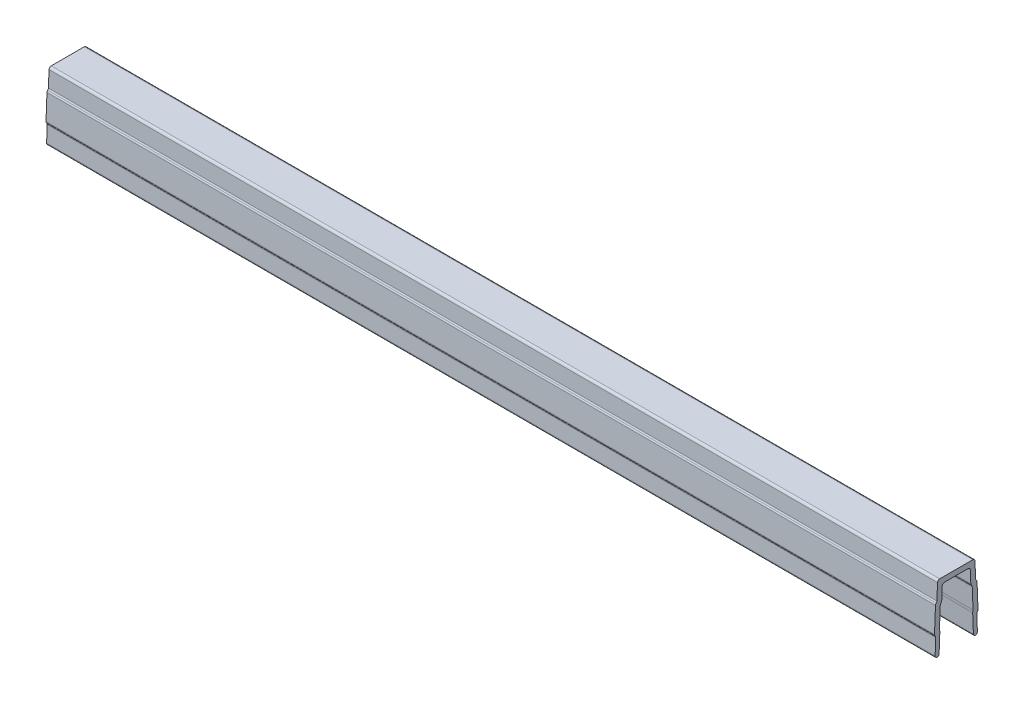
ISO-10303-21;
HEADER;
FILE_DESCRIPTION(('STEP AP214'),'2;1');
FILE_NAME('part.step','',(''),(''),'','','');
FILE_SCHEMA(('AUTOMOTIVE_DESIGN { 1 0 10303 214 1 1 1 1 }'));
ENDSEC;
DATA;
#1=APPLICATION_CONTEXT('core data for automotive mechanical design processes');
#2=APPLICATION_PROTOCOL_DEFINITION('international standard','automotive_design',2000,#1);
#3=PRODUCT_CONTEXT('',#1,'mechanical');
#4=PRODUCT('Part','Part','',(#3));
#5=PRODUCT_RELATED_PRODUCT_CATEGORY('part','',(#4));
#6=PRODUCT_DEFINITION_FORMATION('','',#4);
#7=PRODUCT_DEFINITION_CONTEXT('part definition',#1,'design');
#8=PRODUCT_DEFINITION('design','',#6,#7);
#9=PRODUCT_DEFINITION_SHAPE('','',#8);
#10=(LENGTH_UNIT() NAMED_UNIT(*) SI_UNIT(.MILLI.,.METRE.));
#11=(NAMED_UNIT(*) PLANE_ANGLE_UNIT() SI_UNIT($,.RADIAN.));
#12=(NAMED_UNIT(*) SI_UNIT($,.STERADIAN.) SOLID_ANGLE_UNIT());
#13=UNCERTAINTY_MEASURE_WITH_UNIT(LENGTH_MEASURE(1.E-05),#10,'distance_accuracy_value','');
#14=(GEOMETRIC_REPRESENTATION_CONTEXT(3) GLOBAL_UNCERTAINTY_ASSIGNED_CONTEXT((#13)) GLOBAL_UNIT_ASSIGNED_CONTEXT((#10,
#11,#12)) REPRESENTATION_CONTEXT('',''));
#15=CARTESIAN_POINT('',(0.,0.,0.));
#16=DIRECTION('',(0.,0.,1.));
#17=DIRECTION('',(1.,0.,0.));
#18=AXIS2_PLACEMENT_3D('',#15,#16,#17);
#19=CARTESIAN_POINT('',(200.,2.84730209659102,4.31222095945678));
#20=DIRECTION('',(-1.,0.,0.));
#21=DIRECTION('',(0.,0.,1.));
#22=AXIS2_PLACEMENT_3D('',#19,#20,#21);
#23=CYLINDRICAL_SURFACE('',#22,0.50000000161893);
#24=CARTESIAN_POINT('',(0.,2.84730209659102,4.31222095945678));
#25=DIRECTION('',(1.,0.,0.));
#26=DIRECTION('',(0.,0.,-1.));
#27=AXIS2_PLACEMENT_3D('',#24,#25,#26);
#28=CIRCLE('',#27,0.50000000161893);
#29=CARTESIAN_POINT('',(0.,3.21416703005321,4.65194161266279));
#30=VERTEX_POINT('',#29);
#31=CARTESIAN_POINT('',(0.,2.86649599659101,4.81185241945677));
#32=VERTEX_POINT('',#31);
#33=EDGE_CURVE('E480',#30,#32,#28,.T.);
#34=ORIENTED_EDGE('',*,*,#33,.T.);
#35=DIRECTION('',(-1.,0.,0.));
#36=VECTOR('',#35,1.);
#37=CARTESIAN_POINT('',(200.,2.86649599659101,4.81185241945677));
#38=LINE('',#37,#36);
#39=CARTESIAN_POINT('',(200.,2.86649599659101,4.81185241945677));
#40=VERTEX_POINT('',#39);
#41=EDGE_CURVE('E12',#40,#32,#38,.T.);
#42=ORIENTED_EDGE('',*,*,#41,.F.);
#43=CARTESIAN_POINT('',(200.,2.84730209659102,4.31222095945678));
#44=DIRECTION('',(1.,0.,0.));
#45=DIRECTION('',(0.,0.,-1.));
#46=AXIS2_PLACEMENT_3D('',#43,#44,#45);
#47=CIRCLE('',#46,0.50000000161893);
#48=CARTESIAN_POINT('',(200.,3.21416703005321,4.65194161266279));
#49=VERTEX_POINT('',#48);
#50=EDGE_CURVE('E604',#49,#40,#47,.T.);
#51=ORIENTED_EDGE('',*,*,#50,.F.);
#52=DIRECTION('',(-1.,0.,0.));
#53=VECTOR('',#52,1.);
#54=CARTESIAN_POINT('',(200.,3.21416703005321,4.65194161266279));
#55=LINE('',#54,#53);
#56=EDGE_CURVE('E476',#49,#30,#55,.T.);
#57=ORIENTED_EDGE('',*,*,#56,.T.);
#58=EDGE_LOOP('',(#34,#42,#51,#57));
#59=FACE_BOUND('',#58,.T.);
#60=ADVANCED_FACE('F175',(#59),#23,.T.);
#61=CARTESIAN_POINT('',(200.,2.86649599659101,4.81185241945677));
#62=DIRECTION('',(0.,-0.0383878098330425,-0.999262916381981));
#63=DIRECTION('',(0.,0.999262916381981,-0.0383878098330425));
#64=AXIS2_PLACEMENT_3D('',#61,#62,#63);
#65=PLANE('',#64);
#66=DIRECTION('',(0.,-0.999262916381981,0.0383878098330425));
#67=VECTOR('',#66,1.);
#68=CARTESIAN_POINT('',(0.,2.86649599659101,4.81185241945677));
#69=LINE('',#68,#67);
#70=CARTESIAN_POINT('',(0.,-2.70097016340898,5.02573289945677));
#71=VERTEX_POINT('',#70);
#72=EDGE_CURVE('E484',#32,#71,#69,.T.);
#73=ORIENTED_EDGE('',*,*,#72,.T.);
#74=DIRECTION('',(-1.,0.,0.));
#75=VECTOR('',#74,1.);
#76=CARTESIAN_POINT('',(200.,-2.70097016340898,5.02573289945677));
#77=LINE('',#76,#75);
#78=CARTESIAN_POINT('',(200.,-2.70097016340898,5.02573289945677));
#79=VERTEX_POINT('',#78);
#80=EDGE_CURVE('E184',#79,#71,#77,.T.);
#81=ORIENTED_EDGE('',*,*,#80,.F.);
#82=DIRECTION('',(0.,-0.999262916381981,0.0383878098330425));
#83=VECTOR('',#82,1.);
#84=CARTESIAN_POINT('',(200.,2.86649599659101,4.81185241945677));
#85=LINE('',#84,#83);
#86=EDGE_CURVE('E337',#40,#79,#85,.T.);
#87=ORIENTED_EDGE('',*,*,#86,.F.);
#88=ORIENTED_EDGE('',*,*,#41,.T.);
#89=EDGE_LOOP('',(#73,#81,#87,#88));
#90=FACE_BOUND('',#89,.T.);
#91=ADVANCED_FACE('F908',(#90),#65,.F.);
#92=CARTESIAN_POINT('',(200.,-2.72016407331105,4.52610144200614));
#93=DIRECTION('',(-1.,0.,0.));
#94=DIRECTION('',(0.,0.,1.));
#95=AXIS2_PLACEMENT_3D('',#92,#93,#94);
#96=CYLINDRICAL_SURFACE('',#95,0.499999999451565);
#97=CARTESIAN_POINT('',(0.,-2.72016407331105,4.52610144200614));
#98=DIRECTION('',(1.,0.,0.));
#99=DIRECTION('',(0.,0.,-1.));
#100=AXIS2_PLACEMENT_3D('',#97,#98,#99);
#101=CIRCLE('',#100,0.499999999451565);
#102=CARTESIAN_POINT('',(0.,-3.05988472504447,4.89296637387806));
#103=VERTEX_POINT('',#102);
#104=EDGE_CURVE('E487',#71,#103,#101,.T.);
#105=ORIENTED_EDGE('',*,*,#104,.T.);
#106=DIRECTION('',(-1.,0.,0.));
#107=VECTOR('',#106,1.);
#108=CARTESIAN_POINT('',(200.,-3.05988472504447,4.89296637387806));
#109=LINE('',#108,#107);
#110=CARTESIAN_POINT('',(200.,-3.05988472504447,4.89296637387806));
#111=VERTEX_POINT('',#110);
#112=EDGE_CURVE('E751',#111,#103,#109,.T.);
#113=ORIENTED_EDGE('',*,*,#112,.F.);
#114=CARTESIAN_POINT('',(200.,-2.72016407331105,4.52610144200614));
#115=DIRECTION('',(1.,0.,0.));
#116=DIRECTION('',(0.,0.,-1.));
#117=AXIS2_PLACEMENT_3D('',#114,#115,#116);
#118=CIRCLE('',#117,0.499999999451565);
#119=EDGE_CURVE('E761',#79,#111,#118,.T.);
#120=ORIENTED_EDGE('',*,*,#119,.F.);
#121=ORIENTED_EDGE('',*,*,#80,.T.);
#122=EDGE_LOOP('',(#105,#113,#120,#121));
#123=FACE_BOUND('',#122,.T.);
#124=ADVANCED_FACE('F759',(#123),#96,.T.);
#125=CARTESIAN_POINT('',(200.,-3.05988472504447,4.89296637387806));
#126=DIRECTION('',(0.,0.679441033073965,-0.733730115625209));
#127=DIRECTION('',(0.,0.733730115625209,0.679441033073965));
#128=AXIS2_PLACEMENT_3D('',#125,#126,#127);
#129=PLANE('',#128);
#130=DIRECTION('',(0.,-0.733730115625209,-0.679441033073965));
#131=VECTOR('',#130,1.);
#132=CARTESIAN_POINT('',(0.,-3.05988472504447,4.89296637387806));
#133=LINE('',#132,#131);
#134=CARTESIAN_POINT('',(0.,-3.06725908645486,4.88613764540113));
#135=VERTEX_POINT('',#134);
#136=EDGE_CURVE('E490',#103,#135,#133,.T.);
#137=ORIENTED_EDGE('',*,*,#136,.T.);
#138=DIRECTION('',(-1.,0.,0.));
#139=VECTOR('',#138,1.);
#140=CARTESIAN_POINT('',(200.,-3.06725908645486,4.88613764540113));
#141=LINE('',#140,#139);
#142=CARTESIAN_POINT('',(200.,-3.06725908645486,4.88613764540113));
#143=VERTEX_POINT('',#142);
#144=EDGE_CURVE('E747',#143,#135,#141,.T.);
#145=ORIENTED_EDGE('',*,*,#144,.F.);
#146=DIRECTION('',(0.,-0.733730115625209,-0.679441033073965));
#147=VECTOR('',#146,1.);
#148=CARTESIAN_POINT('',(200.,-3.05988472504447,4.89296637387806));
#149=LINE('',#148,#147);
#150=EDGE_CURVE('E780',#111,#143,#149,.T.);
#151=ORIENTED_EDGE('',*,*,#150,.F.);
#152=ORIENTED_EDGE('',*,*,#112,.T.);
#153=EDGE_LOOP('',(#137,#145,#151,#152));
#154=FACE_BOUND('',#153,.T.);
#155=ADVANCED_FACE('F770',(#154),#129,.F.);
#156=CARTESIAN_POINT('',(200.,-3.40697974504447,5.25300257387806));
#157=DIRECTION('',(-1.,0.,0.));
#158=DIRECTION('',(0.,0.,1.));
#159=AXIS2_PLACEMENT_3D('',#156,#157,#158);
#160=CYLINDRICAL_SURFACE('',#159,0.500000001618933);
#161=CARTESIAN_POINT('',(0.,-3.40697974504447,5.25300257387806));
#162=DIRECTION('',(-1.,0.,0.));
#163=DIRECTION('',(0.,0.,-1.));
#164=AXIS2_PLACEMENT_3D('',#161,#162,#163);
#165=CIRCLE('',#164,0.500000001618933);
#166=CARTESIAN_POINT('',(0.,-3.42617364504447,4.75337111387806));
#167=VERTEX_POINT('',#166);
#168=EDGE_CURVE('E493',#135,#167,#165,.T.);
#169=ORIENTED_EDGE('',*,*,#168,.T.);
#170=DIRECTION('',(-1.,0.,0.));
#171=VECTOR('',#170,1.);
#172=CARTESIAN_POINT('',(200.,-3.42617364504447,4.75337111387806));
#173=LINE('',#172,#171);
#174=CARTESIAN_POINT('',(200.,-3.42617364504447,4.75337111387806));
#175=VERTEX_POINT('',#174);
#176=EDGE_CURVE('E743',#175,#167,#173,.T.);
#177=ORIENTED_EDGE('',*,*,#176,.F.);
#178=CARTESIAN_POINT('',(200.,-3.40697974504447,5.25300257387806));
#179=DIRECTION('',(-1.,0.,0.));
#180=DIRECTION('',(0.,0.,-1.));
#181=AXIS2_PLACEMENT_3D('',#178,#179,#180);
#182=CIRCLE('',#181,0.500000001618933);
#183=EDGE_CURVE('E776',#143,#175,#182,.T.);
#184=ORIENTED_EDGE('',*,*,#183,.F.);
#185=ORIENTED_EDGE('',*,*,#144,.T.);
#186=EDGE_LOOP('',(#169,#177,#184,#185));
#187=FACE_BOUND('',#186,.T.);
#188=ADVANCED_FACE('F774',(#187),#160,.F.);
#189=CARTESIAN_POINT('',(200.,-3.42617364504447,4.75337111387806));
#190=DIRECTION('',(0.,-0.0383878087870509,-0.999262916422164));
#191=DIRECTION('',(0.,0.999262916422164,-0.0383878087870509));
#192=AXIS2_PLACEMENT_3D('',#189,#190,#191);
#193=PLANE('',#192);
#194=DIRECTION('',(0.,-0.999262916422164,0.0383878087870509));
#195=VECTOR('',#194,1.);
#196=CARTESIAN_POINT('',(0.,-3.42617364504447,4.75337111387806));
#197=LINE('',#196,#195);
#198=CARTESIAN_POINT('',(0.,-6.96733873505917,4.88940895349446));
#199=VERTEX_POINT('',#198);
#200=EDGE_CURVE('E496',#167,#199,#197,.T.);
#201=ORIENTED_EDGE('',*,*,#200,.T.);
#202=DIRECTION('',(-1.,0.,0.));
#203=VECTOR('',#202,1.);
#204=CARTESIAN_POINT('',(200.,-6.96733873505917,4.88940895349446));
#205=LINE('',#204,#203);
#206=CARTESIAN_POINT('',(200.,-6.96733873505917,4.88940895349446));
#207=VERTEX_POINT('',#206);
#208=EDGE_CURVE('E739',#207,#199,#205,.T.);
#209=ORIENTED_EDGE('',*,*,#208,.F.);
#210=DIRECTION('',(0.,-0.999262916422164,0.0383878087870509));
#211=VECTOR('',#210,1.);
#212=CARTESIAN_POINT('',(200.,-3.42617364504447,4.75337111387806));
#213=LINE('',#212,#211);
#214=EDGE_CURVE('E779',#175,#207,#213,.T.);
#215=ORIENTED_EDGE('',*,*,#214,.F.);
#216=ORIENTED_EDGE('',*,*,#176,.T.);
#217=EDGE_LOOP('',(#201,#209,#215,#216));
#218=FACE_BOUND('',#217,.T.);
#219=ADVANCED_FACE('F921',(#218),#193,.F.);
#220=CARTESIAN_POINT('',(200.,-6.98461325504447,4.43974064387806));
#221=DIRECTION('',(-1.,0.,0.));
#222=DIRECTION('',(0.,0.,1.));
#223=AXIS2_PLACEMENT_3D('',#220,#221,#222);
#224=CYLINDRICAL_SURFACE('',#223,0.44999999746);
#225=CARTESIAN_POINT('',(0.,-6.98461325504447,4.43974064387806));
#226=DIRECTION('',(1.,0.,0.));
#227=DIRECTION('',(0.,0.,-1.));
#228=AXIS2_PLACEMENT_3D('',#225,#226,#227);
#229=CIRCLE('',#228,0.44999999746);
#230=CARTESIAN_POINT('',(0.,-7.00188776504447,3.99007233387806));
#231=VERTEX_POINT('',#230);
#232=EDGE_CURVE('E499',#199,#231,#229,.T.);
#233=ORIENTED_EDGE('',*,*,#232,.T.);
#234=DIRECTION('',(-1.,0.,0.));
#235=VECTOR('',#234,1.);
#236=CARTESIAN_POINT('',(200.,-7.00188776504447,3.99007233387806));
#237=LINE('',#236,#235);
#238=CARTESIAN_POINT('',(200.,-7.00188776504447,3.99007233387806));
#239=VERTEX_POINT('',#238);
#240=EDGE_CURVE('E735',#239,#231,#237,.T.);
#241=ORIENTED_EDGE('',*,*,#240,.F.);
#242=CARTESIAN_POINT('',(200.,-6.98461325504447,4.43974064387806));
#243=DIRECTION('',(1.,0.,0.));
#244=DIRECTION('',(0.,0.,-1.));
#245=AXIS2_PLACEMENT_3D('',#242,#243,#244);
#246=CIRCLE('',#245,0.44999999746);
#247=EDGE_CURVE('E784',#207,#239,#246,.T.);
#248=ORIENTED_EDGE('',*,*,#247,.F.);
#249=ORIENTED_EDGE('',*,*,#208,.T.);
#250=EDGE_LOOP('',(#233,#241,#248,#249));
#251=FACE_BOUND('',#250,.T.);
#252=ADVANCED_FACE('F924',(#251),#224,.T.);
#253=CARTESIAN_POINT('',(200.,-7.00188776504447,3.99007233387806));
#254=DIRECTION('',(0.,0.0383878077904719,0.999262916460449));
#255=DIRECTION('',(0.,-0.999262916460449,0.0383878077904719));
#256=AXIS2_PLACEMENT_3D('',#253,#254,#255);
#257=PLANE('',#256);
#258=DIRECTION('',(0.,0.999262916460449,-0.0383878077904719));
#259=VECTOR('',#258,1.);
#260=CARTESIAN_POINT('',(0.,-7.00188776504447,3.99007233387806));
#261=LINE('',#260,#259);
#262=CARTESIAN_POINT('',(0.,-2.72730507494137,3.82585943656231));
#263=VERTEX_POINT('',#262);
#264=EDGE_CURVE('E502',#231,#263,#261,.T.);
#265=ORIENTED_EDGE('',*,*,#264,.T.);
#266=DIRECTION('',(-1.,0.,0.));
#267=VECTOR('',#266,1.);
#268=CARTESIAN_POINT('',(200.,-2.72730507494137,3.82585943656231));
#269=LINE('',#268,#267);
#270=CARTESIAN_POINT('',(200.,-2.72730507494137,3.82585943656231));
#271=VERTEX_POINT('',#270);
#272=EDGE_CURVE('E731',#271,#263,#269,.T.);
#273=ORIENTED_EDGE('',*,*,#272,.F.);
#274=DIRECTION('',(0.,0.999262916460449,-0.0383878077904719));
#275=VECTOR('',#274,1.);
#276=CARTESIAN_POINT('',(200.,-7.00188776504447,3.99007233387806));
#277=LINE('',#276,#275);
#278=EDGE_CURVE('E791',#239,#271,#277,.T.);
#279=ORIENTED_EDGE('',*,*,#278,.F.);
#280=ORIENTED_EDGE('',*,*,#240,.T.);
#281=EDGE_LOOP('',(#265,#273,#279,#280));
#282=FACE_BOUND('',#281,.T.);
#283=ADVANCED_FACE('F928',(#282),#257,.F.);
#284=CARTESIAN_POINT('',(200.,-2.70811117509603,4.32549089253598));
#285=DIRECTION('',(-1.,0.,0.));
#286=DIRECTION('',(0.,0.,1.));
#287=AXIS2_PLACEMENT_3D('',#284,#285,#286);
#288=CYLINDRICAL_SURFACE('',#287,0.49999999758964);
#289=CARTESIAN_POINT('',(0.,-2.70811117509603,4.32549089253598));
#290=DIRECTION('',(1.,0.,0.));
#291=DIRECTION('',(0.,0.,-1.));
#292=AXIS2_PLACEMENT_3D('',#289,#290,#291);
#293=CIRCLE('',#292,0.49999999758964);
#294=CARTESIAN_POINT('',(0.,-2.50760138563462,3.86745615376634));
#295=VERTEX_POINT('',#294);
#296=EDGE_CURVE('E505',#263,#295,#293,.T.);
#297=ORIENTED_EDGE('',*,*,#296,.T.);
#298=DIRECTION('',(-1.,0.,0.));
#299=VECTOR('',#298,1.);
#300=CARTESIAN_POINT('',(200.,-2.50760138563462,3.86745615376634));
#301=LINE('',#300,#299);
#302=CARTESIAN_POINT('',(200.,-2.50760138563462,3.86745615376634));
#303=VERTEX_POINT('',#302);
#304=EDGE_CURVE('E727',#303,#295,#301,.T.);
#305=ORIENTED_EDGE('',*,*,#304,.F.);
#306=CARTESIAN_POINT('',(200.,-2.70811117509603,4.32549089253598));
#307=DIRECTION('',(1.,0.,0.));
#308=DIRECTION('',(0.,0.,-1.));
#309=AXIS2_PLACEMENT_3D('',#306,#307,#308);
#310=CIRCLE('',#309,0.49999999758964);
#311=EDGE_CURVE('E794',#271,#303,#310,.T.);
#312=ORIENTED_EDGE('',*,*,#311,.F.);
#313=ORIENTED_EDGE('',*,*,#272,.T.);
#314=EDGE_LOOP('',(#297,#305,#312,#313));
#315=FACE_BOUND('',#314,.T.);
#316=ADVANCED_FACE('F932',(#315),#288,.T.);
#317=CARTESIAN_POINT('',(200.,-2.30709159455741,3.40942141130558));
#318=DIRECTION('',(-1.,0.,0.));
#319=DIRECTION('',(0.,0.,1.));
#320=AXIS2_PLACEMENT_3D('',#317,#318,#319);
#321=CYLINDRICAL_SURFACE('',#320,0.500000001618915);
#322=CARTESIAN_POINT('',(0.,-2.30709159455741,3.40942141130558));
#323=DIRECTION('',(-1.,0.,0.));
#324=DIRECTION('',(0.,0.,-1.));
#325=AXIS2_PLACEMENT_3D('',#322,#323,#324);
#326=CIRCLE('',#325,0.500000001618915);
#327=CARTESIAN_POINT('',(0.,-2.28789769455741,3.90905287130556));
#328=VERTEX_POINT('',#327);
#329=EDGE_CURVE('E508',#295,#328,#326,.T.);
#330=ORIENTED_EDGE('',*,*,#329,.T.);
#331=DIRECTION('',(-1.,0.,0.));
#332=VECTOR('',#331,1.);
#333=CARTESIAN_POINT('',(200.,-2.28789769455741,3.90905287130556));
#334=LINE('',#333,#332);
#335=CARTESIAN_POINT('',(200.,-2.28789769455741,3.90905287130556));
#336=VERTEX_POINT('',#335);
#337=EDGE_CURVE('E723',#336,#328,#334,.T.);
#338=ORIENTED_EDGE('',*,*,#337,.F.);
#339=CARTESIAN_POINT('',(200.,-2.30709159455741,3.40942141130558));
#340=DIRECTION('',(-1.,0.,0.));
#341=DIRECTION('',(0.,0.,-1.));
#342=AXIS2_PLACEMENT_3D('',#339,#340,#341);
#343=CIRCLE('',#342,0.500000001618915);
#344=EDGE_CURVE('E797',#303,#336,#343,.T.);
#345=ORIENTED_EDGE('',*,*,#344,.F.);
#346=ORIENTED_EDGE('',*,*,#304,.T.);
#347=EDGE_LOOP('',(#330,#338,#345,#346));
#348=FACE_BOUND('',#347,.T.);
#349=ADVANCED_FACE('F936',(#348),#321,.F.);
#350=CARTESIAN_POINT('',(200.,-2.28789769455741,3.90905287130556));
#351=DIRECTION('',(0.,0.0383878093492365,0.999262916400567));
#352=DIRECTION('',(0.,-0.999262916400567,0.0383878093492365));
#353=AXIS2_PLACEMENT_3D('',#350,#351,#352);
#354=PLANE('',#353);
#355=DIRECTION('',(0.,0.999262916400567,-0.0383878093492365));
#356=VECTOR('',#355,1.);
#357=CARTESIAN_POINT('',(0.,-2.28789769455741,3.90905287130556));
#358=LINE('',#357,#356);
#359=CARTESIAN_POINT('',(0.,2.36897031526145,3.73015404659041));
#360=VERTEX_POINT('',#359);
#361=EDGE_CURVE('E511',#328,#360,#358,.T.);
#362=ORIENTED_EDGE('',*,*,#361,.T.);
#363=DIRECTION('',(-1.,0.,0.));
#364=VECTOR('',#363,1.);
#365=CARTESIAN_POINT('',(200.,2.36897031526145,3.73015404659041));
#366=LINE('',#365,#364);
#367=CARTESIAN_POINT('',(200.,2.36897031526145,3.73015404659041));
#368=VERTEX_POINT('',#367);
#369=EDGE_CURVE('E719',#368,#360,#366,.T.);
#370=ORIENTED_EDGE('',*,*,#369,.F.);
#371=DIRECTION('',(0.,0.999262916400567,-0.0383878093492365));
#372=VECTOR('',#371,1.);
#373=CARTESIAN_POINT('',(200.,-2.28789769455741,3.90905287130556));
#374=LINE('',#373,#372);
#375=EDGE_CURVE('E800',#336,#368,#374,.T.);
#376=ORIENTED_EDGE('',*,*,#375,.F.);
#377=ORIENTED_EDGE('',*,*,#337,.T.);
#378=EDGE_LOOP('',(#362,#370,#376,#377));
#379=FACE_BOUND('',#378,.T.);
#380=ADVANCED_FACE('F940',(#379),#354,.F.);
#381=CARTESIAN_POINT('',(200.,2.34977641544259,3.23052259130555));
#382=DIRECTION('',(-1.,0.,0.));
#383=DIRECTION('',(0.,0.,1.));
#384=AXIS2_PLACEMENT_3D('',#381,#382,#383);
#385=CYLINDRICAL_SURFACE('',#384,0.499999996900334);
#386=CARTESIAN_POINT('',(0.,2.34977641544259,3.23052259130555));
#387=DIRECTION('',(-1.,0.,0.));
#388=DIRECTION('',(0.,0.,-1.));
#389=AXIS2_PLACEMENT_3D('',#386,#387,#388);
#390=CIRCLE('',#389,0.499999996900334);
#391=CARTESIAN_POINT('',(0.,2.71664134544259,3.57024324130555));
#392=VERTEX_POINT('',#391);
#393=EDGE_CURVE('E514',#360,#392,#390,.T.);
#394=ORIENTED_EDGE('',*,*,#393,.T.);
#395=DIRECTION('',(-1.,0.,0.));
#396=VECTOR('',#395,1.);
#397=CARTESIAN_POINT('',(200.,2.71664134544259,3.57024324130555));
#398=LINE('',#397,#396);
#399=CARTESIAN_POINT('',(200.,2.71664134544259,3.57024324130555));
#400=VERTEX_POINT('',#399);
#401=EDGE_CURVE('E715',#400,#392,#398,.T.);
#402=ORIENTED_EDGE('',*,*,#401,.F.);
#403=CARTESIAN_POINT('',(200.,2.34977641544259,3.23052259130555));
#404=DIRECTION('',(-1.,0.,0.));
#405=DIRECTION('',(0.,0.,-1.));
#406=AXIS2_PLACEMENT_3D('',#403,#404,#405);
#407=CIRCLE('',#406,0.499999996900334);
#408=EDGE_CURVE('E803',#368,#400,#407,.T.);
#409=ORIENTED_EDGE('',*,*,#408,.F.);
#410=ORIENTED_EDGE('',*,*,#369,.T.);
#411=EDGE_LOOP('',(#394,#402,#409,#410));
#412=FACE_BOUND('',#411,.T.);
#413=ADVANCED_FACE('F944',(#412),#385,.F.);
#414=CARTESIAN_POINT('',(200.,2.71664134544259,3.57024324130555));
#415=DIRECTION('',(0.,0.733730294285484,0.679440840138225));
#416=DIRECTION('',(0.,-0.679440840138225,0.733730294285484));
#417=AXIS2_PLACEMENT_3D('',#414,#415,#416);
#418=PLANE('',#417);
#419=DIRECTION('',(0.,0.679440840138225,-0.733730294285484));
#420=VECTOR('',#419,1.);
#421=CARTESIAN_POINT('',(0.,2.71664134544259,3.57024324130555));
#422=LINE('',#421,#420);
#423=CARTESIAN_POINT('',(0.,2.7234700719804,3.56286887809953));
#424=VERTEX_POINT('',#423);
#425=EDGE_CURVE('E517',#392,#424,#422,.T.);
#426=ORIENTED_EDGE('',*,*,#425,.T.);
#427=DIRECTION('',(-1.,0.,0.));
#428=VECTOR('',#427,1.);
#429=CARTESIAN_POINT('',(200.,2.7234700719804,3.56286887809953));
#430=LINE('',#429,#428);
#431=CARTESIAN_POINT('',(200.,2.7234700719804,3.56286887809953));
#432=VERTEX_POINT('',#431);
#433=EDGE_CURVE('E711',#432,#424,#430,.T.);
#434=ORIENTED_EDGE('',*,*,#433,.F.);
#435=DIRECTION('',(0.,0.679440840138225,-0.733730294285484));
#436=VECTOR('',#435,1.);
#437=CARTESIAN_POINT('',(200.,2.71664134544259,3.57024324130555));
#438=LINE('',#437,#436);
#439=EDGE_CURVE('E806',#400,#432,#438,.T.);
#440=ORIENTED_EDGE('',*,*,#439,.F.);
#441=ORIENTED_EDGE('',*,*,#401,.T.);
#442=EDGE_LOOP('',(#426,#434,#440,#441));
#443=FACE_BOUND('',#442,.T.);
#444=ADVANCED_FACE('F948',(#443),#418,.F.);
#445=CARTESIAN_POINT('',(200.,3.09033500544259,3.90258953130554));
#446=DIRECTION('',(-1.,0.,0.));
#447=DIRECTION('',(0.,0.,1.));
#448=AXIS2_PLACEMENT_3D('',#445,#446,#447);
#449=CYLINDRICAL_SURFACE('',#448,0.500000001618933);
#450=CARTESIAN_POINT('',(0.,3.09033500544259,3.90258953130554));
#451=DIRECTION('',(1.,0.,0.));
#452=DIRECTION('',(0.,0.,-1.));
#453=AXIS2_PLACEMENT_3D('',#450,#451,#452);
#454=CIRCLE('',#453,0.500000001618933);
#455=CARTESIAN_POINT('',(0.,3.07114110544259,3.40295807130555));
#456=VERTEX_POINT('',#455);
#457=EDGE_CURVE('E520',#424,#456,#454,.T.);
#458=ORIENTED_EDGE('',*,*,#457,.T.);
#459=DIRECTION('',(-1.,0.,0.));
#460=VECTOR('',#459,1.);
#461=CARTESIAN_POINT('',(200.,3.07114110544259,3.40295807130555));
#462=LINE('',#461,#460);
#463=CARTESIAN_POINT('',(200.,3.07114110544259,3.40295807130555));
#464=VERTEX_POINT('',#463);
#465=EDGE_CURVE('E707',#464,#456,#462,.T.);
#466=ORIENTED_EDGE('',*,*,#465,.F.);
#467=CARTESIAN_POINT('',(200.,3.09033500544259,3.90258953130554));
#468=DIRECTION('',(1.,0.,0.));
#469=DIRECTION('',(0.,0.,-1.));
#470=AXIS2_PLACEMENT_3D('',#467,#468,#469);
#471=CIRCLE('',#470,0.500000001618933);
#472=EDGE_CURVE('E809',#432,#464,#471,.T.);
#473=ORIENTED_EDGE('',*,*,#472,.F.);
#474=ORIENTED_EDGE('',*,*,#433,.T.);
#475=EDGE_LOOP('',(#458,#466,#473,#474));
#476=FACE_BOUND('',#475,.T.);
#477=ADVANCED_FACE('F952',(#476),#449,.T.);
#478=CARTESIAN_POINT('',(200.,3.07114110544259,3.40295807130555));
#479=DIRECTION('',(0.,0.0383878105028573,0.999262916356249));
#480=DIRECTION('',(0.,-0.999262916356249,0.0383878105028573));
#481=AXIS2_PLACEMENT_3D('',#478,#479,#480);
#482=PLANE('',#481);
#483=DIRECTION('',(0.,0.999262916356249,-0.0383878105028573));
#484=VECTOR('',#483,1.);
#485=CARTESIAN_POINT('',(0.,3.07114110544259,3.40295807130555));
#486=LINE('',#485,#484);
#487=CARTESIAN_POINT('',(0.,5.88491234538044,3.2948638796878));
#488=VERTEX_POINT('',#487);
#489=EDGE_CURVE('E523',#456,#488,#486,.T.);
#490=ORIENTED_EDGE('',*,*,#489,.T.);
#491=DIRECTION('',(-1.,0.,0.));
#492=VECTOR('',#491,1.);
#493=CARTESIAN_POINT('',(200.,5.88491234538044,3.2948638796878));
#494=LINE('',#493,#492);
#495=CARTESIAN_POINT('',(200.,5.88491234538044,3.2948638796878));
#496=VERTEX_POINT('',#495);
#497=EDGE_CURVE('E703',#496,#488,#494,.T.);
#498=ORIENTED_EDGE('',*,*,#497,.F.);
#499=DIRECTION('',(0.,0.999262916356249,-0.0383878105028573));
#500=VECTOR('',#499,1.);
#501=CARTESIAN_POINT('',(200.,3.07114110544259,3.40295807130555));
#502=LINE('',#501,#500);
#503=EDGE_CURVE('E812',#464,#496,#502,.T.);
#504=ORIENTED_EDGE('',*,*,#503,.F.);
#505=ORIENTED_EDGE('',*,*,#465,.T.);
#506=EDGE_LOOP('',(#490,#498,#504,#505));
#507=FACE_BOUND('',#506,.T.);
#508=ADVANCED_FACE('F956',(#507),#482,.F.);
#509=CARTESIAN_POINT('',(200.,5.86571844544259,2.79523242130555));
#510=DIRECTION('',(-1.,0.,0.));
#511=DIRECTION('',(0.,0.,1.));
#512=AXIS2_PLACEMENT_3D('',#509,#510,#511);
#513=CYLINDRICAL_SURFACE('',#512,0.5);
#514=CARTESIAN_POINT('',(0.,5.86571844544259,2.79523242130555));
#515=DIRECTION('',(-1.,0.,0.));
#516=DIRECTION('',(0.,0.,-1.));
#517=AXIS2_PLACEMENT_3D('',#514,#515,#516);
#518=CIRCLE('',#517,0.5);
#519=CARTESIAN_POINT('',(0.,6.36571844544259,2.79523240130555));
#520=VERTEX_POINT('',#519);
#521=EDGE_CURVE('E526',#488,#520,#518,.T.);
#522=ORIENTED_EDGE('',*,*,#521,.T.);
#523=DIRECTION('',(-1.,0.,0.));
#524=VECTOR('',#523,1.);
#525=CARTESIAN_POINT('',(200.,6.36571844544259,2.79523240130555));
#526=LINE('',#525,#524);
#527=CARTESIAN_POINT('',(200.,6.36571844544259,2.79523240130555));
#528=VERTEX_POINT('',#527);
#529=EDGE_CURVE('E699',#528,#520,#526,.T.);
#530=ORIENTED_EDGE('',*,*,#529,.F.);
#531=CARTESIAN_POINT('',(200.,5.86571844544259,2.79523242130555));
#532=DIRECTION('',(-1.,0.,0.));
#533=DIRECTION('',(0.,0.,-1.));
#534=AXIS2_PLACEMENT_3D('',#531,#532,#533);
#535=CIRCLE('',#534,0.5);
#536=EDGE_CURVE('E815',#496,#528,#535,.T.);
#537=ORIENTED_EDGE('',*,*,#536,.F.);
#538=ORIENTED_EDGE('',*,*,#497,.T.);
#539=EDGE_LOOP('',(#522,#530,#537,#538));
#540=FACE_BOUND('',#539,.T.);
#541=ADVANCED_FACE('F960',(#540),#513,.F.);
#542=CARTESIAN_POINT('',(200.,6.36571844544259,2.79523240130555));
#543=DIRECTION('',(0.,1.,0.));
#544=DIRECTION('',(0.,0.,1.));
#545=AXIS2_PLACEMENT_3D('',#542,#543,#544);
#546=PLANE('',#545);
#547=DIRECTION('',(0.,0.,-1.));
#548=VECTOR('',#547,1.);
#549=CARTESIAN_POINT('',(0.,6.36571844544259,2.79523240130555));
#550=LINE('',#549,#548);
#551=CARTESIAN_POINT('',(0.,6.36571844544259,-2.53302201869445));
#552=VERTEX_POINT('',#551);
#553=EDGE_CURVE('E529',#520,#552,#550,.T.);
#554=ORIENTED_EDGE('',*,*,#553,.T.);
#555=DIRECTION('',(-1.,0.,0.));
#556=VECTOR('',#555,1.);
#557=CARTESIAN_POINT('',(200.,6.36571844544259,-2.53302201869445));
#558=LINE('',#557,#556);
#559=CARTESIAN_POINT('',(200.,6.36571844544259,-2.53302201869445));
#560=VERTEX_POINT('',#559);
#561=EDGE_CURVE('E695',#560,#552,#558,.T.);
#562=ORIENTED_EDGE('',*,*,#561,.F.);
#563=DIRECTION('',(0.,0.,-1.));
#564=VECTOR('',#563,1.);
#565=CARTESIAN_POINT('',(200.,6.36571844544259,2.79523240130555));
#566=LINE('',#565,#564);
#567=EDGE_CURVE('E818',#528,#560,#566,.T.);
#568=ORIENTED_EDGE('',*,*,#567,.F.);
#569=ORIENTED_EDGE('',*,*,#529,.T.);
#570=EDGE_LOOP('',(#554,#562,#568,#569));
#571=FACE_BOUND('',#570,.T.);
#572=ADVANCED_FACE('F964',(#571),#546,.F.);
#573=CARTESIAN_POINT('',(200.,5.86571844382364,-2.53302201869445));
#574=DIRECTION('',(-1.,0.,0.));
#575=DIRECTION('',(0.,0.,1.));
#576=AXIS2_PLACEMENT_3D('',#573,#574,#575);
#577=CYLINDRICAL_SURFACE('',#576,0.500000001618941);
#578=CARTESIAN_POINT('',(0.,5.86571844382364,-2.53302201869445));
#579=DIRECTION('',(-1.,0.,0.));
#580=DIRECTION('',(0.,0.,-1.));
#581=AXIS2_PLACEMENT_3D('',#578,#579,#580);
#582=CIRCLE('',#581,0.500000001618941);
#583=CARTESIAN_POINT('',(0.,5.88491234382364,-3.03265347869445));
#584=VERTEX_POINT('',#583);
#585=EDGE_CURVE('E532',#552,#584,#582,.T.);
#586=ORIENTED_EDGE('',*,*,#585,.T.);
#587=DIRECTION('',(-1.,0.,0.));
#588=VECTOR('',#587,1.);
#589=CARTESIAN_POINT('',(200.,5.88491234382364,-3.03265347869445));
#590=LINE('',#589,#588);
#591=CARTESIAN_POINT('',(200.,5.88491234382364,-3.03265347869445));
#592=VERTEX_POINT('',#591);
#593=EDGE_CURVE('E691',#592,#584,#590,.T.);
#594=ORIENTED_EDGE('',*,*,#593,.F.);
#595=CARTESIAN_POINT('',(200.,5.86571844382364,-2.53302201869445));
#596=DIRECTION('',(-1.,0.,0.));
#597=DIRECTION('',(0.,0.,-1.));
#598=AXIS2_PLACEMENT_3D('',#595,#596,#597);
#599=CIRCLE('',#598,0.500000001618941);
#600=EDGE_CURVE('E821',#560,#592,#599,.T.);
#601=ORIENTED_EDGE('',*,*,#600,.F.);
#602=ORIENTED_EDGE('',*,*,#561,.T.);
#603=EDGE_LOOP('',(#586,#594,#601,#602));
#604=FACE_BOUND('',#603,.T.);
#605=ADVANCED_FACE('F968',(#604),#577,.F.);
#606=CARTESIAN_POINT('',(200.,5.88491234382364,-3.03265347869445));
#607=DIRECTION('',(0.,0.0383878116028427,-0.999262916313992));
#608=DIRECTION('',(0.,0.999262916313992,0.0383878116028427));
#609=AXIS2_PLACEMENT_3D('',#606,#607,#608);
#610=PLANE('',#609);
#611=DIRECTION('',(0.,-0.999262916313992,-0.0383878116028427));
#612=VECTOR('',#611,1.);
#613=CARTESIAN_POINT('',(0.,5.88491234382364,-3.03265347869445));
#614=LINE('',#613,#612);
#615=CARTESIAN_POINT('',(0.,3.07114110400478,-3.14074767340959));
#616=VERTEX_POINT('',#615);
#617=EDGE_CURVE('E535',#584,#616,#614,.T.);
#618=ORIENTED_EDGE('',*,*,#617,.T.);
#619=DIRECTION('',(-1.,0.,0.));
#620=VECTOR('',#619,1.);
#621=CARTESIAN_POINT('',(200.,3.07114110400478,-3.14074767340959));
#622=LINE('',#621,#620);
#623=CARTESIAN_POINT('',(200.,3.07114110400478,-3.14074767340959));
#624=VERTEX_POINT('',#623);
#625=EDGE_CURVE('E687',#624,#616,#622,.T.);
#626=ORIENTED_EDGE('',*,*,#625,.F.);
#627=DIRECTION('',(0.,-0.999262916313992,-0.0383878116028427));
#628=VECTOR('',#627,1.);
#629=CARTESIAN_POINT('',(200.,5.88491234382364,-3.03265347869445));
#630=LINE('',#629,#628);
#631=EDGE_CURVE('E824',#592,#624,#630,.T.);
#632=ORIENTED_EDGE('',*,*,#631,.F.);
#633=ORIENTED_EDGE('',*,*,#593,.T.);
#634=EDGE_LOOP('',(#618,#626,#632,#633));
#635=FACE_BOUND('',#634,.T.);
#636=ADVANCED_FACE('F972',(#635),#610,.F.);
#637=CARTESIAN_POINT('',(200.,3.09033500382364,-3.64037912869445));
#638=DIRECTION('',(-1.,0.,0.));
#639=DIRECTION('',(0.,0.,1.));
#640=AXIS2_PLACEMENT_3D('',#637,#638,#639);
#641=CYLINDRICAL_SURFACE('',#640,0.499999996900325);
#642=CARTESIAN_POINT('',(0.,3.09033500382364,-3.64037912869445));
#643=DIRECTION('',(1.,0.,0.));
#644=DIRECTION('',(0.,0.,-1.));
#645=AXIS2_PLACEMENT_3D('',#642,#643,#644);
#646=CIRCLE('',#645,0.499999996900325);
#647=CARTESIAN_POINT('',(0.,2.72347007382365,-3.30065847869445));
#648=VERTEX_POINT('',#647);
#649=EDGE_CURVE('E538',#616,#648,#646,.T.);
#650=ORIENTED_EDGE('',*,*,#649,.T.);
#651=DIRECTION('',(-1.,0.,0.));
#652=VECTOR('',#651,1.);
#653=CARTESIAN_POINT('',(200.,2.72347007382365,-3.30065847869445));
#654=LINE('',#653,#652);
#655=CARTESIAN_POINT('',(200.,2.72347007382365,-3.30065847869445));
#656=VERTEX_POINT('',#655);
#657=EDGE_CURVE('E683',#656,#648,#654,.T.);
#658=ORIENTED_EDGE('',*,*,#657,.F.);
#659=CARTESIAN_POINT('',(200.,3.09033500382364,-3.64037912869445));
#660=DIRECTION('',(1.,0.,0.));
#661=DIRECTION('',(0.,0.,-1.));
#662=AXIS2_PLACEMENT_3D('',#659,#660,#661);
#663=CIRCLE('',#662,0.499999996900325);
#664=EDGE_CURVE('E827',#624,#656,#663,.T.);
#665=ORIENTED_EDGE('',*,*,#664,.F.);
#666=ORIENTED_EDGE('',*,*,#625,.T.);
#667=EDGE_LOOP('',(#650,#658,#665,#666));
#668=FACE_BOUND('',#667,.T.);
#669=ADVANCED_FACE('F976',(#668),#641,.T.);
#670=CARTESIAN_POINT('',(200.,2.72347007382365,-3.30065847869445));
#671=DIRECTION('',(0.,0.733730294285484,-0.679440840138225));
#672=DIRECTION('',(0.,0.679440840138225,0.733730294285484));
#673=AXIS2_PLACEMENT_3D('',#670,#671,#672);
#674=PLANE('',#673);
#675=DIRECTION('',(0.,-0.679440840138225,-0.733730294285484));
#676=VECTOR('',#675,1.);
#677=CARTESIAN_POINT('',(0.,2.72347007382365,-3.30065847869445));
#678=LINE('',#677,#676);
#679=CARTESIAN_POINT('',(0.,2.71664134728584,-3.30803284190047));
#680=VERTEX_POINT('',#679);
#681=EDGE_CURVE('E541',#648,#680,#678,.T.);
#682=ORIENTED_EDGE('',*,*,#681,.T.);
#683=DIRECTION('',(-1.,0.,0.));
#684=VECTOR('',#683,1.);
#685=CARTESIAN_POINT('',(200.,2.71664134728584,-3.30803284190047));
#686=LINE('',#685,#684);
#687=CARTESIAN_POINT('',(200.,2.71664134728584,-3.30803284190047));
#688=VERTEX_POINT('',#687);
#689=EDGE_CURVE('E679',#688,#680,#686,.T.);
#690=ORIENTED_EDGE('',*,*,#689,.F.);
#691=DIRECTION('',(0.,-0.679440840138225,-0.733730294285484));
#692=VECTOR('',#691,1.);
#693=CARTESIAN_POINT('',(200.,2.72347007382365,-3.30065847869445));
#694=LINE('',#693,#692);
#695=EDGE_CURVE('E830',#656,#688,#694,.T.);
#696=ORIENTED_EDGE('',*,*,#695,.F.);
#697=ORIENTED_EDGE('',*,*,#657,.T.);
#698=EDGE_LOOP('',(#682,#690,#696,#697));
#699=FACE_BOUND('',#698,.T.);
#700=ADVANCED_FACE('F980',(#699),#674,.F.);
#701=CARTESIAN_POINT('',(200.,2.34977641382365,-2.96831218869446));
#702=DIRECTION('',(-1.,0.,0.));
#703=DIRECTION('',(0.,0.,1.));
#704=AXIS2_PLACEMENT_3D('',#701,#702,#703);
#705=CYLINDRICAL_SURFACE('',#704,0.500000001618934);
#706=CARTESIAN_POINT('',(0.,2.34977641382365,-2.96831218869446));
#707=DIRECTION('',(-1.,0.,0.));
#708=DIRECTION('',(0.,0.,-1.));
#709=AXIS2_PLACEMENT_3D('',#706,#707,#708);
#710=CIRCLE('',#709,0.500000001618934);
#711=CARTESIAN_POINT('',(0.,2.36897031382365,-3.46794364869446));
#712=VERTEX_POINT('',#711);
#713=EDGE_CURVE('E544',#680,#712,#710,.T.);
#714=ORIENTED_EDGE('',*,*,#713,.T.);
#715=DIRECTION('',(-1.,0.,0.));
#716=VECTOR('',#715,1.);
#717=CARTESIAN_POINT('',(200.,2.36897031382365,-3.46794364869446));
#718=LINE('',#717,#716);
#719=CARTESIAN_POINT('',(200.,2.36897031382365,-3.46794364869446));
#720=VERTEX_POINT('',#719);
#721=EDGE_CURVE('E675',#720,#712,#718,.T.);
#722=ORIENTED_EDGE('',*,*,#721,.F.);
#723=CARTESIAN_POINT('',(200.,2.34977641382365,-2.96831218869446));
#724=DIRECTION('',(-1.,0.,0.));
#725=DIRECTION('',(0.,0.,-1.));
#726=AXIS2_PLACEMENT_3D('',#723,#724,#725);
#727=CIRCLE('',#726,0.500000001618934);
#728=EDGE_CURVE('E833',#688,#720,#727,.T.);
#729=ORIENTED_EDGE('',*,*,#728,.F.);
#730=ORIENTED_EDGE('',*,*,#689,.T.);
#731=EDGE_LOOP('',(#714,#722,#729,#730));
#732=FACE_BOUND('',#731,.T.);
#733=ADVANCED_FACE('F984',(#732),#705,.F.);
#734=CARTESIAN_POINT('',(200.,2.36897031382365,-3.46794364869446));
#735=DIRECTION('',(0.,0.0383878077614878,-0.999262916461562));
#736=DIRECTION('',(0.,0.999262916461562,0.0383878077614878));
#737=AXIS2_PLACEMENT_3D('',#734,#735,#736);
#738=PLANE('',#737);
#739=DIRECTION('',(0.,-0.999262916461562,-0.0383878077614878));
#740=VECTOR('',#739,1.);
#741=CARTESIAN_POINT('',(0.,2.36897031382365,-3.46794364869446));
#742=LINE('',#741,#740);
#743=CARTESIAN_POINT('',(0.,-2.28789769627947,-3.64684246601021));
#744=VERTEX_POINT('',#743);
#745=EDGE_CURVE('E547',#712,#744,#742,.T.);
#746=ORIENTED_EDGE('',*,*,#745,.T.);
#747=DIRECTION('',(-1.,0.,0.));
#748=VECTOR('',#747,1.);
#749=CARTESIAN_POINT('',(200.,-2.28789769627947,-3.64684246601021));
#750=LINE('',#749,#748);
#751=CARTESIAN_POINT('',(200.,-2.28789769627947,-3.64684246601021));
#752=VERTEX_POINT('',#751);
#753=EDGE_CURVE('E671',#752,#744,#750,.T.);
#754=ORIENTED_EDGE('',*,*,#753,.F.);
#755=DIRECTION('',(0.,-0.999262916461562,-0.0383878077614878));
#756=VECTOR('',#755,1.);
#757=CARTESIAN_POINT('',(200.,2.36897031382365,-3.46794364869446));
#758=LINE('',#757,#756);
#759=EDGE_CURVE('E836',#720,#752,#758,.T.);
#760=ORIENTED_EDGE('',*,*,#759,.F.);
#761=ORIENTED_EDGE('',*,*,#721,.T.);
#762=EDGE_LOOP('',(#746,#754,#760,#761));
#763=FACE_BOUND('',#762,.T.);
#764=ADVANCED_FACE('F988',(#763),#738,.F.);
#765=CARTESIAN_POINT('',(200.,-2.3070915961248,-3.14721101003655));
#766=DIRECTION('',(-1.,0.,0.));
#767=DIRECTION('',(0.,0.,1.));
#768=AXIS2_PLACEMENT_3D('',#765,#766,#767);
#769=CYLINDRICAL_SURFACE('',#768,0.499999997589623);
#770=CARTESIAN_POINT('',(0.,-2.3070915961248,-3.14721101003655));
#771=DIRECTION('',(-1.,0.,0.));
#772=DIRECTION('',(0.,0.,-1.));
#773=AXIS2_PLACEMENT_3D('',#770,#771,#772);
#774=CIRCLE('',#773,0.499999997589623);
#775=CARTESIAN_POINT('',(0.,-2.50760138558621,-3.60524574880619));
#776=VERTEX_POINT('',#775);
#777=EDGE_CURVE('E550',#744,#776,#774,.T.);
#778=ORIENTED_EDGE('',*,*,#777,.T.);
#779=DIRECTION('',(-1.,0.,0.));
#780=VECTOR('',#779,1.);
#781=CARTESIAN_POINT('',(200.,-2.50760138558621,-3.60524574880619));
#782=LINE('',#781,#780);
#783=CARTESIAN_POINT('',(200.,-2.50760138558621,-3.60524574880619));
#784=VERTEX_POINT('',#783);
#785=EDGE_CURVE('E667',#784,#776,#782,.T.);
#786=ORIENTED_EDGE('',*,*,#785,.F.);
#787=CARTESIAN_POINT('',(200.,-2.3070915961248,-3.14721101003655));
#788=DIRECTION('',(-1.,0.,0.));
#789=DIRECTION('',(0.,0.,-1.));
#790=AXIS2_PLACEMENT_3D('',#787,#788,#789);
#791=CIRCLE('',#790,0.499999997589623);
#792=EDGE_CURVE('E839',#752,#784,#791,.T.);
#793=ORIENTED_EDGE('',*,*,#792,.F.);
#794=ORIENTED_EDGE('',*,*,#753,.T.);
#795=EDGE_LOOP('',(#778,#786,#793,#794));
#796=FACE_BOUND('',#795,.T.);
#797=ADVANCED_FACE('F992',(#796),#769,.F.);
#798=CARTESIAN_POINT('',(200.,-2.70811117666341,-4.06328049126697));
#799=DIRECTION('',(-1.,0.,0.));
#800=DIRECTION('',(0.,0.,1.));
#801=AXIS2_PLACEMENT_3D('',#798,#799,#800);
#802=CYLINDRICAL_SURFACE('',#801,0.500000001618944);
#803=CARTESIAN_POINT('',(0.,-2.70811117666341,-4.06328049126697));
#804=DIRECTION('',(1.,0.,0.));
#805=DIRECTION('',(0.,0.,-1.));
#806=AXIS2_PLACEMENT_3D('',#803,#804,#805);
#807=CIRCLE('',#806,0.500000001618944);
#808=CARTESIAN_POINT('',(0.,-2.72730507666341,-3.56364903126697));
#809=VERTEX_POINT('',#808);
#810=EDGE_CURVE('E553',#776,#809,#807,.T.);
#811=ORIENTED_EDGE('',*,*,#810,.T.);
#812=DIRECTION('',(-1.,0.,0.));
#813=VECTOR('',#812,1.);
#814=CARTESIAN_POINT('',(200.,-2.72730507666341,-3.56364903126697));
#815=LINE('',#814,#813);
#816=CARTESIAN_POINT('',(200.,-2.72730507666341,-3.56364903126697));
#817=VERTEX_POINT('',#816);
#818=EDGE_CURVE('E663',#817,#809,#815,.T.);
#819=ORIENTED_EDGE('',*,*,#818,.F.);
#820=CARTESIAN_POINT('',(200.,-2.70811117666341,-4.06328049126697));
#821=DIRECTION('',(1.,0.,0.));
#822=DIRECTION('',(0.,0.,-1.));
#823=AXIS2_PLACEMENT_3D('',#820,#821,#822);
#824=CIRCLE('',#823,0.500000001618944);
#825=EDGE_CURVE('E842',#784,#817,#824,.T.);
#826=ORIENTED_EDGE('',*,*,#825,.F.);
#827=ORIENTED_EDGE('',*,*,#785,.T.);
#828=EDGE_LOOP('',(#811,#819,#826,#827));
#829=FACE_BOUND('',#828,.T.);
#830=ADVANCED_FACE('F996',(#829),#802,.T.);
#831=CARTESIAN_POINT('',(200.,-2.72730507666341,-3.56364903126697));
#832=DIRECTION('',(0.,0.0383878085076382,-0.999262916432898));
#833=DIRECTION('',(0.,0.999262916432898,0.0383878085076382));
#834=AXIS2_PLACEMENT_3D('',#831,#832,#833);
#835=PLANE('',#834);
#836=DIRECTION('',(0.,-0.999262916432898,-0.0383878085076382));
#837=VECTOR('',#836,1.);
#838=CARTESIAN_POINT('',(0.,-2.72730507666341,-3.56364903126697));
#839=LINE('',#838,#837);
#840=CARTESIAN_POINT('',(0.,-7.00188776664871,-3.72786193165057));
#841=VERTEX_POINT('',#840);
#842=EDGE_CURVE('E556',#809,#841,#839,.T.);
#843=ORIENTED_EDGE('',*,*,#842,.T.);
#844=DIRECTION('',(-1.,0.,0.));
#845=VECTOR('',#844,1.);
#846=CARTESIAN_POINT('',(200.,-7.00188776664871,-3.72786193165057));
#847=LINE('',#846,#845);
#848=CARTESIAN_POINT('',(200.,-7.00188776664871,-3.72786193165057));
#849=VERTEX_POINT('',#848);
#850=EDGE_CURVE('E659',#849,#841,#847,.T.);
#851=ORIENTED_EDGE('',*,*,#850,.F.);
#852=DIRECTION('',(0.,-0.999262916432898,-0.0383878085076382));
#853=VECTOR('',#852,1.);
#854=CARTESIAN_POINT('',(200.,-2.72730507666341,-3.56364903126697));
#855=LINE('',#854,#853);
#856=EDGE_CURVE('E845',#817,#849,#855,.T.);
#857=ORIENTED_EDGE('',*,*,#856,.F.);
#858=ORIENTED_EDGE('',*,*,#818,.T.);
#859=EDGE_LOOP('',(#843,#851,#857,#858));
#860=FACE_BOUND('',#859,.T.);
#861=ADVANCED_FACE('F1000',(#860),#835,.F.);
#862=CARTESIAN_POINT('',(200.,-6.98461324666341,-4.17753024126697));
#863=DIRECTION('',(-1.,0.,0.));
#864=DIRECTION('',(0.,0.,1.));
#865=AXIS2_PLACEMENT_3D('',#862,#863,#864);
#866=CYLINDRICAL_SURFACE('',#865,0.449999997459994);
#867=CARTESIAN_POINT('',(0.,-6.98461324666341,-4.17753024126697));
#868=DIRECTION('',(1.,0.,0.));
#869=DIRECTION('',(0.,0.,-1.));
#870=AXIS2_PLACEMENT_3D('',#867,#868,#869);
#871=CIRCLE('',#870,0.449999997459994);
#872=CARTESIAN_POINT('',(0.,-6.96733873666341,-4.62719855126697));
#873=VERTEX_POINT('',#872);
#874=EDGE_CURVE('E559',#841,#873,#871,.T.);
#875=ORIENTED_EDGE('',*,*,#874,.T.);
#876=DIRECTION('',(-1.,0.,0.));
#877=VECTOR('',#876,1.);
#878=CARTESIAN_POINT('',(200.,-6.96733873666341,-4.62719855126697));
#879=LINE('',#878,#877);
#880=CARTESIAN_POINT('',(200.,-6.96733873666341,-4.62719855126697));
#881=VERTEX_POINT('',#880);
#882=EDGE_CURVE('E655',#881,#873,#879,.T.);
#883=ORIENTED_EDGE('',*,*,#882,.F.);
#884=CARTESIAN_POINT('',(200.,-6.98461324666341,-4.17753024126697));
#885=DIRECTION('',(1.,0.,0.));
#886=DIRECTION('',(0.,0.,-1.));
#887=AXIS2_PLACEMENT_3D('',#884,#885,#886);
#888=CIRCLE('',#887,0.449999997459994);
#889=EDGE_CURVE('E848',#849,#881,#888,.T.);
#890=ORIENTED_EDGE('',*,*,#889,.F.);
#891=ORIENTED_EDGE('',*,*,#850,.T.);
#892=EDGE_LOOP('',(#875,#883,#890,#891));
#893=FACE_BOUND('',#892,.T.);
#894=ADVANCED_FACE('F1004',(#893),#866,.T.);
#895=CARTESIAN_POINT('',(200.,-6.96733873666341,-4.62719855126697));
#896=DIRECTION('',(0.,-0.0383878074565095,0.999262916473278));
#897=DIRECTION('',(0.,-0.999262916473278,-0.0383878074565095));
#898=AXIS2_PLACEMENT_3D('',#895,#896,#897);
#899=PLANE('',#898);
#900=DIRECTION('',(0.,0.999262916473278,0.0383878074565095));
#901=VECTOR('',#900,1.);
#902=CARTESIAN_POINT('',(0.,-6.96733873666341,-4.62719855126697));
#903=LINE('',#902,#901);
#904=CARTESIAN_POINT('',(0.,-3.42617364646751,-4.4911607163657));
#905=VERTEX_POINT('',#904);
#906=EDGE_CURVE('E562',#873,#905,#903,.T.);
#907=ORIENTED_EDGE('',*,*,#906,.T.);
#908=DIRECTION('',(-1.,0.,0.));
#909=VECTOR('',#908,1.);
#910=CARTESIAN_POINT('',(200.,-3.42617364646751,-4.4911607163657));
#911=LINE('',#910,#909);
#912=CARTESIAN_POINT('',(200.,-3.42617364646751,-4.4911607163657));
#913=VERTEX_POINT('',#912);
#914=EDGE_CURVE('E651',#913,#905,#911,.T.);
#915=ORIENTED_EDGE('',*,*,#914,.F.);
#916=DIRECTION('',(0.,0.999262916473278,0.0383878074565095));
#917=VECTOR('',#916,1.);
#918=CARTESIAN_POINT('',(200.,-6.96733873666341,-4.62719855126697));
#919=LINE('',#918,#917);
#920=EDGE_CURVE('E851',#881,#913,#919,.T.);
#921=ORIENTED_EDGE('',*,*,#920,.F.);
#922=ORIENTED_EDGE('',*,*,#882,.T.);
#923=EDGE_LOOP('',(#907,#915,#921,#922));
#924=FACE_BOUND('',#923,.T.);
#925=ADVANCED_FACE('F1008',(#924),#899,.F.);
#926=CARTESIAN_POINT('',(200.,-3.40697973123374,-4.9907921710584));
#927=DIRECTION('',(-1.,0.,0.));
#928=DIRECTION('',(0.,0.,1.));
#929=AXIS2_PLACEMENT_3D('',#926,#927,#928);
#930=CYLINDRICAL_SURFACE('',#929,0.499999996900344);
#931=CARTESIAN_POINT('',(0.,-3.40697973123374,-4.9907921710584));
#932=DIRECTION('',(-1.,0.,0.));
#933=DIRECTION('',(0.,0.,-1.));
#934=AXIS2_PLACEMENT_3D('',#931,#932,#933);
#935=CIRCLE('',#934,0.499999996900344);
#936=CARTESIAN_POINT('',(0.,-3.06725908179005,-4.62392724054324));
#937=VERTEX_POINT('',#936);
#938=EDGE_CURVE('E565',#905,#937,#935,.T.);
#939=ORIENTED_EDGE('',*,*,#938,.T.);
#940=DIRECTION('',(-1.,0.,0.));
#941=VECTOR('',#940,1.);
#942=CARTESIAN_POINT('',(200.,-3.06725908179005,-4.62392724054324));
#943=LINE('',#942,#941);
#944=CARTESIAN_POINT('',(200.,-3.06725908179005,-4.62392724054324));
#945=VERTEX_POINT('',#944);
#946=EDGE_CURVE('E647',#945,#937,#943,.T.);
#947=ORIENTED_EDGE('',*,*,#946,.F.);
#948=CARTESIAN_POINT('',(200.,-3.40697973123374,-4.9907921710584));
#949=DIRECTION('',(-1.,0.,0.));
#950=DIRECTION('',(0.,0.,-1.));
#951=AXIS2_PLACEMENT_3D('',#948,#949,#950);
#952=CIRCLE('',#951,0.499999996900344);
#953=EDGE_CURVE('E854',#913,#945,#952,.T.);
#954=ORIENTED_EDGE('',*,*,#953,.F.);
#955=ORIENTED_EDGE('',*,*,#914,.T.);
#956=EDGE_LOOP('',(#939,#947,#954,#955));
#957=FACE_BOUND('',#956,.T.);
#958=ADVANCED_FACE('F1012',(#957),#930,.F.);
#959=CARTESIAN_POINT('',(200.,-3.06725908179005,-4.62392724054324));
#960=DIRECTION('',(0.,0.679441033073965,0.733730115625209));
#961=DIRECTION('',(0.,-0.733730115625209,0.679441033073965));
#962=AXIS2_PLACEMENT_3D('',#959,#960,#961);
#963=PLANE('',#962);
#964=DIRECTION('',(0.,0.733730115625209,-0.679441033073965));
#965=VECTOR('',#964,1.);
#966=CARTESIAN_POINT('',(0.,-3.06725908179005,-4.62392724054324));
#967=LINE('',#966,#965);
#968=CARTESIAN_POINT('',(0.,-3.05988472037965,-4.63075596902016));
#969=VERTEX_POINT('',#968);
#970=EDGE_CURVE('E568',#937,#969,#967,.T.);
#971=ORIENTED_EDGE('',*,*,#970,.T.);
#972=DIRECTION('',(-1.,0.,0.));
#973=VECTOR('',#972,1.);
#974=CARTESIAN_POINT('',(200.,-3.05988472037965,-4.63075596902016));
#975=LINE('',#974,#973);
#976=CARTESIAN_POINT('',(200.,-3.05988472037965,-4.63075596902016));
#977=VERTEX_POINT('',#976);
#978=EDGE_CURVE('E643',#977,#969,#975,.T.);
#979=ORIENTED_EDGE('',*,*,#978,.F.);
#980=DIRECTION('',(0.,0.733730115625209,-0.679441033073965));
#981=VECTOR('',#980,1.);
#982=CARTESIAN_POINT('',(200.,-3.06725908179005,-4.62392724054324));
#983=LINE('',#982,#981);
#984=EDGE_CURVE('E857',#945,#977,#983,.T.);
#985=ORIENTED_EDGE('',*,*,#984,.F.);
#986=ORIENTED_EDGE('',*,*,#946,.T.);
#987=EDGE_LOOP('',(#971,#979,#985,#986));
#988=FACE_BOUND('',#987,.T.);
#989=ADVANCED_FACE('F1016',(#988),#963,.F.);
#990=CARTESIAN_POINT('',(200.,-2.72016406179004,-4.26389104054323));
#991=DIRECTION('',(-1.,0.,0.));
#992=DIRECTION('',(0.,0.,1.));
#993=AXIS2_PLACEMENT_3D('',#990,#991,#992);
#994=CYLINDRICAL_SURFACE('',#993,0.500000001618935);
#995=CARTESIAN_POINT('',(0.,-2.72016406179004,-4.26389104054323));
#996=DIRECTION('',(1.,0.,0.));
#997=DIRECTION('',(0.,0.,-1.));
#998=AXIS2_PLACEMENT_3D('',#995,#996,#997);
#999=CIRCLE('',#998,0.500000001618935);
#1000=CARTESIAN_POINT('',(0.,-2.70097016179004,-4.76352250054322));
#1001=VERTEX_POINT('',#1000);
#1002=EDGE_CURVE('E571',#969,#1001,#999,.T.);
#1003=ORIENTED_EDGE('',*,*,#1002,.T.);
#1004=DIRECTION('',(-1.,0.,0.));
#1005=VECTOR('',#1004,1.);
#1006=CARTESIAN_POINT('',(200.,-2.70097016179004,-4.76352250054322));
#1007=LINE('',#1006,#1005);
#1008=CARTESIAN_POINT('',(200.,-2.70097016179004,-4.76352250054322));
#1009=VERTEX_POINT('',#1008);
#1010=EDGE_CURVE('E639',#1009,#1001,#1007,.T.);
#1011=ORIENTED_EDGE('',*,*,#1010,.F.);
#1012=CARTESIAN_POINT('',(200.,-2.72016406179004,-4.26389104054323));
#1013=DIRECTION('',(1.,0.,0.));
#1014=DIRECTION('',(0.,0.,-1.));
#1015=AXIS2_PLACEMENT_3D('',#1012,#1013,#1014);
#1016=CIRCLE('',#1015,0.500000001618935);
#1017=EDGE_CURVE('E860',#977,#1009,#1016,.T.);
#1018=ORIENTED_EDGE('',*,*,#1017,.F.);
#1019=ORIENTED_EDGE('',*,*,#978,.T.);
#1020=EDGE_LOOP('',(#1003,#1011,#1018,#1019));
#1021=FACE_BOUND('',#1020,.T.);
#1022=ADVANCED_FACE('F1020',(#1021),#994,.T.);
#1023=CARTESIAN_POINT('',(200.,-2.70097016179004,-4.76352250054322));
#1024=DIRECTION('',(0.,-0.0383878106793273,0.99926291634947));
#1025=DIRECTION('',(0.,-0.99926291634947,-0.0383878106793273));
#1026=AXIS2_PLACEMENT_3D('',#1023,#1024,#1025);
#1027=PLANE('',#1026);
#1028=DIRECTION('',(0.,0.99926291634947,0.0383878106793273));
#1029=VECTOR('',#1028,1.);
#1030=CARTESIAN_POINT('',(0.,-2.70097016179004,-4.76352250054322));
#1031=LINE('',#1030,#1029);
#1032=CARTESIAN_POINT('',(0.,2.86649599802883,-4.54964201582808));
#1033=VERTEX_POINT('',#1032);
#1034=EDGE_CURVE('E574',#1001,#1033,#1031,.T.);
#1035=ORIENTED_EDGE('',*,*,#1034,.T.);
#1036=DIRECTION('',(-1.,0.,0.));
#1037=VECTOR('',#1036,1.);
#1038=CARTESIAN_POINT('',(200.,2.86649599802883,-4.54964201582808));
#1039=LINE('',#1038,#1037);
#1040=CARTESIAN_POINT('',(200.,2.86649599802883,-4.54964201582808));
#1041=VERTEX_POINT('',#1040);
#1042=EDGE_CURVE('E635',#1041,#1033,#1039,.T.);
#1043=ORIENTED_EDGE('',*,*,#1042,.F.);
#1044=DIRECTION('',(0.,0.99926291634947,0.0383878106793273));
#1045=VECTOR('',#1044,1.);
#1046=CARTESIAN_POINT('',(200.,-2.70097016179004,-4.76352250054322));
#1047=LINE('',#1046,#1045);
#1048=EDGE_CURVE('E863',#1009,#1041,#1047,.T.);
#1049=ORIENTED_EDGE('',*,*,#1048,.F.);
#1050=ORIENTED_EDGE('',*,*,#1010,.T.);
#1051=EDGE_LOOP('',(#1035,#1043,#1049,#1050));
#1052=FACE_BOUND('',#1051,.T.);
#1053=ADVANCED_FACE('F1024',(#1052),#1027,.F.);
#1054=CARTESIAN_POINT('',(200.,2.84730209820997,-4.05001056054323));
#1055=DIRECTION('',(-1.,0.,0.));
#1056=DIRECTION('',(0.,0.,1.));
#1057=AXIS2_PLACEMENT_3D('',#1054,#1055,#1056);
#1058=CYLINDRICAL_SURFACE('',#1057,0.499999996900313);
#1059=CARTESIAN_POINT('',(0.,2.84730209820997,-4.05001056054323));
#1060=DIRECTION('',(1.,0.,0.));
#1061=DIRECTION('',(0.,0.,-1.));
#1062=AXIS2_PLACEMENT_3D('',#1059,#1060,#1061);
#1063=CIRCLE('',#1062,0.499999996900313);
#1064=CARTESIAN_POINT('',(0.,3.21416702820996,-4.38973121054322));
#1065=VERTEX_POINT('',#1064);
#1066=EDGE_CURVE('E577',#1033,#1065,#1063,.T.);
#1067=ORIENTED_EDGE('',*,*,#1066,.T.);
#1068=DIRECTION('',(-1.,0.,0.));
#1069=VECTOR('',#1068,1.);
#1070=CARTESIAN_POINT('',(200.,3.21416702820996,-4.38973121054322));
#1071=LINE('',#1070,#1069);
#1072=CARTESIAN_POINT('',(200.,3.21416702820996,-4.38973121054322));
#1073=VERTEX_POINT('',#1072);
#1074=EDGE_CURVE('E631',#1073,#1065,#1071,.T.);
#1075=ORIENTED_EDGE('',*,*,#1074,.F.);
#1076=CARTESIAN_POINT('',(200.,2.84730209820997,-4.05001056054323));
#1077=DIRECTION('',(1.,0.,0.));
#1078=DIRECTION('',(0.,0.,-1.));
#1079=AXIS2_PLACEMENT_3D('',#1076,#1077,#1078);
#1080=CIRCLE('',#1079,0.499999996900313);
#1081=EDGE_CURVE('E866',#1041,#1073,#1080,.T.);
#1082=ORIENTED_EDGE('',*,*,#1081,.F.);
#1083=ORIENTED_EDGE('',*,*,#1042,.T.);
#1084=EDGE_LOOP('',(#1067,#1075,#1082,#1083));
#1085=FACE_BOUND('',#1084,.T.);
#1086=ADVANCED_FACE('F1028',(#1085),#1058,.T.);
#1087=CARTESIAN_POINT('',(200.,3.21416702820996,-4.38973121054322));
#1088=DIRECTION('',(0.,-0.733730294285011,0.679440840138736));
#1089=DIRECTION('',(0.,-0.679440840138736,-0.733730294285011));
#1090=AXIS2_PLACEMENT_3D('',#1087,#1088,#1089);
#1091=PLANE('',#1090);
#1092=DIRECTION('',(0.,0.679440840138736,0.733730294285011));
#1093=VECTOR('',#1092,1.);
#1094=CARTESIAN_POINT('',(0.,3.21416702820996,-4.38973121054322));
#1095=LINE('',#1094,#1093);
#1096=CARTESIAN_POINT('',(0.,3.22099575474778,-4.3823568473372));
#1097=VERTEX_POINT('',#1096);
#1098=EDGE_CURVE('E580',#1065,#1097,#1095,.T.);
#1099=ORIENTED_EDGE('',*,*,#1098,.T.);
#1100=DIRECTION('',(-1.,0.,0.));
#1101=VECTOR('',#1100,1.);
#1102=CARTESIAN_POINT('',(200.,3.22099575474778,-4.3823568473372));
#1103=LINE('',#1102,#1101);
#1104=CARTESIAN_POINT('',(200.,3.22099575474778,-4.3823568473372));
#1105=VERTEX_POINT('',#1104);
#1106=EDGE_CURVE('E627',#1105,#1097,#1103,.T.);
#1107=ORIENTED_EDGE('',*,*,#1106,.F.);
#1108=DIRECTION('',(0.,0.679440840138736,0.733730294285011));
#1109=VECTOR('',#1108,1.);
#1110=CARTESIAN_POINT('',(200.,3.21416702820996,-4.38973121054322));
#1111=LINE('',#1110,#1109);
#1112=EDGE_CURVE('E869',#1073,#1105,#1111,.T.);
#1113=ORIENTED_EDGE('',*,*,#1112,.F.);
#1114=ORIENTED_EDGE('',*,*,#1074,.T.);
#1115=EDGE_LOOP('',(#1099,#1107,#1113,#1114));
#1116=FACE_BOUND('',#1115,.T.);
#1117=ADVANCED_FACE('F1032',(#1116),#1091,.F.);
#1118=CARTESIAN_POINT('',(200.,3.58786068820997,-4.72207750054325));
#1119=DIRECTION('',(-1.,0.,0.));
#1120=DIRECTION('',(0.,0.,1.));
#1121=AXIS2_PLACEMENT_3D('',#1118,#1119,#1120);
#1122=CYLINDRICAL_SURFACE('',#1121,0.500000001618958);
#1123=CARTESIAN_POINT('',(0.,3.58786068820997,-4.72207750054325));
#1124=DIRECTION('',(-1.,0.,0.));
#1125=DIRECTION('',(0.,0.,-1.));
#1126=AXIS2_PLACEMENT_3D('',#1123,#1124,#1125);
#1127=CIRCLE('',#1126,0.500000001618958);
#1128=CARTESIAN_POINT('',(0.,3.56866678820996,-4.22244604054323));
#1129=VERTEX_POINT('',#1128);
#1130=EDGE_CURVE('E583',#1097,#1129,#1127,.T.);
#1131=ORIENTED_EDGE('',*,*,#1130,.T.);
#1132=DIRECTION('',(-1.,0.,0.));
#1133=VECTOR('',#1132,1.);
#1134=CARTESIAN_POINT('',(200.,3.56866678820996,-4.22244604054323));
#1135=LINE('',#1134,#1133);
#1136=CARTESIAN_POINT('',(200.,3.56866678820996,-4.22244604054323));
#1137=VERTEX_POINT('',#1136);
#1138=EDGE_CURVE('E623',#1137,#1129,#1135,.T.);
#1139=ORIENTED_EDGE('',*,*,#1138,.F.);
#1140=CARTESIAN_POINT('',(200.,3.58786068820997,-4.72207750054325));
#1141=DIRECTION('',(-1.,0.,0.));
#1142=DIRECTION('',(0.,0.,-1.));
#1143=AXIS2_PLACEMENT_3D('',#1140,#1141,#1142);
#1144=CIRCLE('',#1143,0.500000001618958);
#1145=EDGE_CURVE('E872',#1105,#1137,#1144,.T.);
#1146=ORIENTED_EDGE('',*,*,#1145,.F.);
#1147=ORIENTED_EDGE('',*,*,#1106,.T.);
#1148=EDGE_LOOP('',(#1131,#1139,#1146,#1147));
#1149=FACE_BOUND('',#1148,.T.);
#1150=ADVANCED_FACE('F1036',(#1149),#1122,.F.);
#1151=CARTESIAN_POINT('',(200.,3.56866678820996,-4.22244604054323));
#1152=DIRECTION('',(0.,-0.038387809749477,0.999262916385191));
#1153=DIRECTION('',(0.,-0.999262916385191,-0.038387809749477));
#1154=AXIS2_PLACEMENT_3D('',#1151,#1152,#1153);
#1155=PLANE('',#1154);
#1156=DIRECTION('',(0.,0.999262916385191,0.038387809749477));
#1157=VECTOR('',#1156,1.);
#1158=CARTESIAN_POINT('',(0.,3.56866678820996,-4.22244604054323));
#1159=LINE('',#1158,#1157);
#1160=CARTESIAN_POINT('',(0.,7.08491235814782,-4.08736550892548));
#1161=VERTEX_POINT('',#1160);
#1162=EDGE_CURVE('E586',#1129,#1161,#1159,.T.);
#1163=ORIENTED_EDGE('',*,*,#1162,.T.);
#1164=DIRECTION('',(-1.,0.,0.));
#1165=VECTOR('',#1164,1.);
#1166=CARTESIAN_POINT('',(200.,7.08491235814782,-4.08736550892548));
#1167=LINE('',#1166,#1165);
#1168=CARTESIAN_POINT('',(200.,7.08491235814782,-4.08736550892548));
#1169=VERTEX_POINT('',#1168);
#1170=EDGE_CURVE('E619',#1169,#1161,#1167,.T.);
#1171=ORIENTED_EDGE('',*,*,#1170,.F.);
#1172=DIRECTION('',(0.,0.999262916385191,0.038387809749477));
#1173=VECTOR('',#1172,1.);
#1174=CARTESIAN_POINT('',(200.,3.56866678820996,-4.22244604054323));
#1175=LINE('',#1174,#1173);
#1176=EDGE_CURVE('E875',#1137,#1169,#1175,.T.);
#1177=ORIENTED_EDGE('',*,*,#1176,.F.);
#1178=ORIENTED_EDGE('',*,*,#1138,.T.);
#1179=EDGE_LOOP('',(#1163,#1171,#1177,#1178));
#1180=FACE_BOUND('',#1179,.T.);
#1181=ADVANCED_FACE('F1040',(#1180),#1155,.F.);
#1182=CARTESIAN_POINT('',(200.,7.06571845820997,-3.58773405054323));
#1183=DIRECTION('',(-1.,0.,0.));
#1184=DIRECTION('',(0.,0.,1.));
#1185=AXIS2_PLACEMENT_3D('',#1182,#1183,#1184);
#1186=CYLINDRICAL_SURFACE('',#1185,0.499999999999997);
#1187=CARTESIAN_POINT('',(0.,7.06571845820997,-3.58773405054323));
#1188=DIRECTION('',(1.,0.,0.));
#1189=DIRECTION('',(0.,0.,-1.));
#1190=AXIS2_PLACEMENT_3D('',#1187,#1188,#1189);
#1191=CIRCLE('',#1190,0.499999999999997);
#1192=CARTESIAN_POINT('',(0.,7.56571845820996,-3.58773405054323));
#1193=VERTEX_POINT('',#1192);
#1194=EDGE_CURVE('E589',#1161,#1193,#1191,.T.);
#1195=ORIENTED_EDGE('',*,*,#1194,.T.);
#1196=DIRECTION('',(-1.,0.,0.));
#1197=VECTOR('',#1196,1.);
#1198=CARTESIAN_POINT('',(200.,7.56571845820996,-3.58773405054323));
#1199=LINE('',#1198,#1197);
#1200=CARTESIAN_POINT('',(200.,7.56571845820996,-3.58773405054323));
#1201=VERTEX_POINT('',#1200);
#1202=EDGE_CURVE('E615',#1201,#1193,#1199,.T.);
#1203=ORIENTED_EDGE('',*,*,#1202,.F.);
#1204=CARTESIAN_POINT('',(200.,7.06571845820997,-3.58773405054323));
#1205=DIRECTION('',(1.,0.,0.));
#1206=DIRECTION('',(0.,0.,-1.));
#1207=AXIS2_PLACEMENT_3D('',#1204,#1205,#1206);
#1208=CIRCLE('',#1207,0.499999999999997);
#1209=EDGE_CURVE('E878',#1169,#1201,#1208,.T.);
#1210=ORIENTED_EDGE('',*,*,#1209,.F.);
#1211=ORIENTED_EDGE('',*,*,#1170,.T.);
#1212=EDGE_LOOP('',(#1195,#1203,#1210,#1211));
#1213=FACE_BOUND('',#1212,.T.);
#1214=ADVANCED_FACE('F1044',(#1213),#1186,.T.);
#1215=CARTESIAN_POINT('',(200.,7.56571845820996,-3.58773405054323));
#1216=DIRECTION('',(0.,-1.,0.));
#1217=DIRECTION('',(0.,0.,-1.));
#1218=AXIS2_PLACEMENT_3D('',#1215,#1216,#1217);
#1219=PLANE('',#1218);
#1220=DIRECTION('',(0.,0.,1.));
#1221=VECTOR('',#1220,1.);
#1222=CARTESIAN_POINT('',(0.,7.56571845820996,-3.58773405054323));
#1223=LINE('',#1222,#1221);
#1224=CARTESIAN_POINT('',(0.,7.56571845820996,3.84994444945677));
#1225=VERTEX_POINT('',#1224);
#1226=EDGE_CURVE('E592',#1193,#1225,#1223,.T.);
#1227=ORIENTED_EDGE('',*,*,#1226,.T.);
#1228=DIRECTION('',(-1.,0.,0.));
#1229=VECTOR('',#1228,1.);
#1230=CARTESIAN_POINT('',(200.,7.56571845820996,3.84994444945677));
#1231=LINE('',#1230,#1229);
#1232=CARTESIAN_POINT('',(200.,7.56571845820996,3.84994444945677));
#1233=VERTEX_POINT('',#1232);
#1234=EDGE_CURVE('E611',#1233,#1225,#1231,.T.);
#1235=ORIENTED_EDGE('',*,*,#1234,.F.);
#1236=DIRECTION('',(0.,0.,1.));
#1237=VECTOR('',#1236,1.);
#1238=CARTESIAN_POINT('',(200.,7.56571845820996,-3.58773405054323));
#1239=LINE('',#1238,#1237);
#1240=EDGE_CURVE('E881',#1201,#1233,#1239,.T.);
#1241=ORIENTED_EDGE('',*,*,#1240,.F.);
#1242=ORIENTED_EDGE('',*,*,#1202,.T.);
#1243=EDGE_LOOP('',(#1227,#1235,#1241,#1242));
#1244=FACE_BOUND('',#1243,.T.);
#1245=ADVANCED_FACE('F889',(#1244),#1219,.F.);
#1246=CARTESIAN_POINT('',(200.,7.06571845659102,3.84994444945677));
#1247=DIRECTION('',(-1.,0.,0.));
#1248=DIRECTION('',(0.,0.,1.));
#1249=AXIS2_PLACEMENT_3D('',#1246,#1247,#1248);
#1250=CYLINDRICAL_SURFACE('',#1249,0.50000000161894);
#1251=CARTESIAN_POINT('',(0.,7.06571845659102,3.84994444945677));
#1252=DIRECTION('',(1.,0.,0.));
#1253=DIRECTION('',(0.,0.,-1.));
#1254=AXIS2_PLACEMENT_3D('',#1251,#1252,#1253);
#1255=CIRCLE('',#1254,0.50000000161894);
#1256=CARTESIAN_POINT('',(0.,7.08491235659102,4.34957590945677));
#1257=VERTEX_POINT('',#1256);
#1258=EDGE_CURVE('E595',#1225,#1257,#1255,.T.);
#1259=ORIENTED_EDGE('',*,*,#1258,.T.);
#1260=DIRECTION('',(-1.,0.,0.));
#1261=VECTOR('',#1260,1.);
#1262=CARTESIAN_POINT('',(200.,7.08491235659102,4.34957590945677));
#1263=LINE('',#1262,#1261);
#1264=CARTESIAN_POINT('',(200.,7.08491235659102,4.34957590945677));
#1265=VERTEX_POINT('',#1264);
#1266=EDGE_CURVE('E469',#1265,#1257,#1263,.T.);
#1267=ORIENTED_EDGE('',*,*,#1266,.F.);
#1268=CARTESIAN_POINT('',(200.,7.06571845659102,3.84994444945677));
#1269=DIRECTION('',(1.,0.,0.));
#1270=DIRECTION('',(0.,0.,-1.));
#1271=AXIS2_PLACEMENT_3D('',#1268,#1269,#1270);
#1272=CIRCLE('',#1271,0.50000000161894);
#1273=EDGE_CURVE('E458',#1233,#1265,#1272,.T.);
#1274=ORIENTED_EDGE('',*,*,#1273,.F.);
#1275=ORIENTED_EDGE('',*,*,#1234,.T.);
#1276=EDGE_LOOP('',(#1259,#1267,#1274,#1275));
#1277=FACE_BOUND('',#1276,.T.);
#1278=ADVANCED_FACE('F893',(#1277),#1250,.T.);
#1279=CARTESIAN_POINT('',(200.,7.08491235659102,4.34957590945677));
#1280=DIRECTION('',(0.,-0.0383878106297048,-0.999262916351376));
#1281=DIRECTION('',(0.,0.999262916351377,-0.0383878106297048));
#1282=AXIS2_PLACEMENT_3D('',#1279,#1280,#1281);
#1283=PLANE('',#1282);
#1284=DIRECTION('',(0.,-0.999262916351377,0.0383878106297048));
#1285=VECTOR('',#1284,1.);
#1286=CARTESIAN_POINT('',(0.,7.08491235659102,4.34957590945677));
#1287=LINE('',#1286,#1285);
#1288=CARTESIAN_POINT('',(0.,3.56866678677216,4.4846564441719));
#1289=VERTEX_POINT('',#1288);
#1290=EDGE_CURVE('E467',#1257,#1289,#1287,.T.);
#1291=ORIENTED_EDGE('',*,*,#1290,.T.);
#1292=DIRECTION('',(-1.,0.,0.));
#1293=VECTOR('',#1292,1.);
#1294=CARTESIAN_POINT('',(200.,3.56866678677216,4.4846564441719));
#1295=LINE('',#1294,#1293);
#1296=CARTESIAN_POINT('',(200.,3.56866678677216,4.4846564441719));
#1297=VERTEX_POINT('',#1296);
#1298=EDGE_CURVE('E464',#1297,#1289,#1295,.T.);
#1299=ORIENTED_EDGE('',*,*,#1298,.F.);
#1300=DIRECTION('',(0.,-0.999262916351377,0.0383878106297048));
#1301=VECTOR('',#1300,1.);
#1302=CARTESIAN_POINT('',(200.,7.08491235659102,4.34957590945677));
#1303=LINE('',#1302,#1301);
#1304=EDGE_CURVE('E452',#1265,#1297,#1303,.T.);
#1305=ORIENTED_EDGE('',*,*,#1304,.F.);
#1306=ORIENTED_EDGE('',*,*,#1266,.T.);
#1307=EDGE_LOOP('',(#1291,#1299,#1305,#1306));
#1308=FACE_BOUND('',#1307,.T.);
#1309=ADVANCED_FACE('F465',(#1308),#1283,.F.);
#1310=CARTESIAN_POINT('',(200.,3.58786068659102,4.98428789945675));
#1311=DIRECTION('',(-1.,0.,0.));
#1312=DIRECTION('',(0.,0.,1.));
#1313=AXIS2_PLACEMENT_3D('',#1310,#1311,#1312);
#1314=CYLINDRICAL_SURFACE('',#1313,0.499999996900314);
#1315=CARTESIAN_POINT('',(0.,3.58786068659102,4.98428789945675));
#1316=DIRECTION('',(-1.,0.,0.));
#1317=DIRECTION('',(0.,0.,-1.));
#1318=AXIS2_PLACEMENT_3D('',#1315,#1316,#1317);
#1319=CIRCLE('',#1318,0.499999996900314);
#1320=CARTESIAN_POINT('',(0.,3.22099575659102,4.64456724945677));
#1321=VERTEX_POINT('',#1320);
#1322=EDGE_CURVE('E323',#1289,#1321,#1319,.T.);
#1323=ORIENTED_EDGE('',*,*,#1322,.T.);
#1324=DIRECTION('',(-1.,0.,0.));
#1325=VECTOR('',#1324,1.);
#1326=CARTESIAN_POINT('',(200.,3.22099575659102,4.64456724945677));
#1327=LINE('',#1326,#1325);
#1328=CARTESIAN_POINT('',(200.,3.22099575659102,4.64456724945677));
#1329=VERTEX_POINT('',#1328);
#1330=EDGE_CURVE('E470',#1329,#1321,#1327,.T.);
#1331=ORIENTED_EDGE('',*,*,#1330,.F.);
#1332=CARTESIAN_POINT('',(200.,3.58786068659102,4.98428789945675));
#1333=DIRECTION('',(-1.,0.,0.));
#1334=DIRECTION('',(0.,0.,-1.));
#1335=AXIS2_PLACEMENT_3D('',#1332,#1333,#1334);
#1336=CIRCLE('',#1335,0.499999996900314);
#1337=EDGE_CURVE('E456',#1297,#1329,#1336,.T.);
#1338=ORIENTED_EDGE('',*,*,#1337,.F.);
#1339=ORIENTED_EDGE('',*,*,#1298,.T.);
#1340=EDGE_LOOP('',(#1323,#1331,#1338,#1339));
#1341=FACE_BOUND('',#1340,.T.);
#1342=ADVANCED_FACE('F472',(#1341),#1314,.F.);
#1343=CARTESIAN_POINT('',(200.,3.22099575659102,4.64456724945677));
#1344=DIRECTION('',(0.,-0.733730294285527,-0.679440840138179));
#1345=DIRECTION('',(0.,0.679440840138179,-0.733730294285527));
#1346=AXIS2_PLACEMENT_3D('',#1343,#1344,#1345);
#1347=PLANE('',#1346);
#1348=DIRECTION('',(0.,-0.679440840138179,0.733730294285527));
#1349=VECTOR('',#1348,1.);
#1350=CARTESIAN_POINT('',(0.,3.22099575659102,4.64456724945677));
#1351=LINE('',#1350,#1349);
#1352=EDGE_CURVE('E329',#1321,#30,#1351,.T.);
#1353=ORIENTED_EDGE('',*,*,#1352,.T.);
#1354=ORIENTED_EDGE('',*,*,#56,.F.);
#1355=DIRECTION('',(0.,-0.679440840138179,0.733730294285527));
#1356=VECTOR('',#1355,1.);
#1357=CARTESIAN_POINT('',(200.,3.22099575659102,4.64456724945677));
#1358=LINE('',#1357,#1356);
#1359=EDGE_CURVE('E192',#1329,#49,#1358,.T.);
#1360=ORIENTED_EDGE('',*,*,#1359,.F.);
#1361=ORIENTED_EDGE('',*,*,#1330,.T.);
#1362=EDGE_LOOP('',(#1353,#1354,#1360,#1361));
#1363=FACE_BOUND('',#1362,.T.);
#1364=ADVANCED_FACE('F897',(#1363),#1347,.F.);
#1365=CARTESIAN_POINT('',(200.,2.84730209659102,4.31222095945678));
#1366=DIRECTION('',(1.,0.,0.));
#1367=DIRECTION('',(0.,0.,-1.));
#1368=AXIS2_PLACEMENT_3D('',#1365,#1366,#1367);
#1369=PLANE('',#1368);
#1370=ORIENTED_EDGE('',*,*,#50,.T.);
#1371=ORIENTED_EDGE('',*,*,#86,.T.);
#1372=ORIENTED_EDGE('',*,*,#119,.T.);
#1373=ORIENTED_EDGE('',*,*,#150,.T.);
#1374=ORIENTED_EDGE('',*,*,#183,.T.);
#1375=ORIENTED_EDGE('',*,*,#214,.T.);
#1376=ORIENTED_EDGE('',*,*,#247,.T.);
#1377=ORIENTED_EDGE('',*,*,#278,.T.);
#1378=ORIENTED_EDGE('',*,*,#311,.T.);
#1379=ORIENTED_EDGE('',*,*,#344,.T.);
#1380=ORIENTED_EDGE('',*,*,#375,.T.);
#1381=ORIENTED_EDGE('',*,*,#408,.T.);
#1382=ORIENTED_EDGE('',*,*,#439,.T.);
#1383=ORIENTED_EDGE('',*,*,#472,.T.);
#1384=ORIENTED_EDGE('',*,*,#503,.T.);
#1385=ORIENTED_EDGE('',*,*,#536,.T.);
#1386=ORIENTED_EDGE('',*,*,#567,.T.);
#1387=ORIENTED_EDGE('',*,*,#600,.T.);
#1388=ORIENTED_EDGE('',*,*,#631,.T.);
#1389=ORIENTED_EDGE('',*,*,#664,.T.);
#1390=ORIENTED_EDGE('',*,*,#695,.T.);
#1391=ORIENTED_EDGE('',*,*,#728,.T.);
#1392=ORIENTED_EDGE('',*,*,#759,.T.);
#1393=ORIENTED_EDGE('',*,*,#792,.T.);
#1394=ORIENTED_EDGE('',*,*,#825,.T.);
#1395=ORIENTED_EDGE('',*,*,#856,.T.);
#1396=ORIENTED_EDGE('',*,*,#889,.T.);
#1397=ORIENTED_EDGE('',*,*,#920,.T.);
#1398=ORIENTED_EDGE('',*,*,#953,.T.);
#1399=ORIENTED_EDGE('',*,*,#984,.T.);
#1400=ORIENTED_EDGE('',*,*,#1017,.T.);
#1401=ORIENTED_EDGE('',*,*,#1048,.T.);
#1402=ORIENTED_EDGE('',*,*,#1081,.T.);
#1403=ORIENTED_EDGE('',*,*,#1112,.T.);
#1404=ORIENTED_EDGE('',*,*,#1145,.T.);
#1405=ORIENTED_EDGE('',*,*,#1176,.T.);
#1406=ORIENTED_EDGE('',*,*,#1209,.T.);
#1407=ORIENTED_EDGE('',*,*,#1240,.T.);
#1408=ORIENTED_EDGE('',*,*,#1273,.T.);
#1409=ORIENTED_EDGE('',*,*,#1304,.T.);
#1410=ORIENTED_EDGE('',*,*,#1337,.T.);
#1411=ORIENTED_EDGE('',*,*,#1359,.T.);
#1412=EDGE_LOOP('',(#1370,#1371,#1372,#1373,#1374,#1375,#1376,#1377,#1378,#1379,#1380,#1381,
#1382,#1383,#1384,#1385,#1386,#1387,#1388,#1389,#1390,#1391,#1392,#1393,#1394,#1395,#1396,#1397,
#1398,#1399,#1400,#1401,#1402,#1403,#1404,#1405,#1406,#1407,#1408,#1409,#1410,#1411));
#1413=FACE_BOUND('',#1412,.T.);
#1414=ADVANCED_FACE('F454',(#1413),#1369,.T.);
#1415=CARTESIAN_POINT('',(0.,2.84730209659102,4.31222095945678));
#1416=DIRECTION('',(1.,0.,0.));
#1417=DIRECTION('',(0.,0.,-1.));
#1418=AXIS2_PLACEMENT_3D('',#1415,#1416,#1417);
#1419=PLANE('',#1418);
#1420=ORIENTED_EDGE('',*,*,#33,.F.);
#1421=ORIENTED_EDGE('',*,*,#1352,.F.);
#1422=ORIENTED_EDGE('',*,*,#1322,.F.);
#1423=ORIENTED_EDGE('',*,*,#1290,.F.);
#1424=ORIENTED_EDGE('',*,*,#1258,.F.);
#1425=ORIENTED_EDGE('',*,*,#1226,.F.);
#1426=ORIENTED_EDGE('',*,*,#1194,.F.);
#1427=ORIENTED_EDGE('',*,*,#1162,.F.);
#1428=ORIENTED_EDGE('',*,*,#1130,.F.);
#1429=ORIENTED_EDGE('',*,*,#1098,.F.);
#1430=ORIENTED_EDGE('',*,*,#1066,.F.);
#1431=ORIENTED_EDGE('',*,*,#1034,.F.);
#1432=ORIENTED_EDGE('',*,*,#1002,.F.);
#1433=ORIENTED_EDGE('',*,*,#970,.F.);
#1434=ORIENTED_EDGE('',*,*,#938,.F.);
#1435=ORIENTED_EDGE('',*,*,#906,.F.);
#1436=ORIENTED_EDGE('',*,*,#874,.F.);
#1437=ORIENTED_EDGE('',*,*,#842,.F.);
#1438=ORIENTED_EDGE('',*,*,#810,.F.);
#1439=ORIENTED_EDGE('',*,*,#777,.F.);
#1440=ORIENTED_EDGE('',*,*,#745,.F.);
#1441=ORIENTED_EDGE('',*,*,#713,.F.);
#1442=ORIENTED_EDGE('',*,*,#681,.F.);
#1443=ORIENTED_EDGE('',*,*,#649,.F.);
#1444=ORIENTED_EDGE('',*,*,#617,.F.);
#1445=ORIENTED_EDGE('',*,*,#585,.F.);
#1446=ORIENTED_EDGE('',*,*,#553,.F.);
#1447=ORIENTED_EDGE('',*,*,#521,.F.);
#1448=ORIENTED_EDGE('',*,*,#489,.F.);
#1449=ORIENTED_EDGE('',*,*,#457,.F.);
#1450=ORIENTED_EDGE('',*,*,#425,.F.);
#1451=ORIENTED_EDGE('',*,*,#393,.F.);
#1452=ORIENTED_EDGE('',*,*,#361,.F.);
#1453=ORIENTED_EDGE('',*,*,#329,.F.);
#1454=ORIENTED_EDGE('',*,*,#296,.F.);
#1455=ORIENTED_EDGE('',*,*,#264,.F.);
#1456=ORIENTED_EDGE('',*,*,#232,.F.);
#1457=ORIENTED_EDGE('',*,*,#200,.F.);
#1458=ORIENTED_EDGE('',*,*,#168,.F.);
#1459=ORIENTED_EDGE('',*,*,#136,.F.);
#1460=ORIENTED_EDGE('',*,*,#104,.F.);
#1461=ORIENTED_EDGE('',*,*,#72,.F.);
#1462=EDGE_LOOP('',(#1420,#1421,#1422,#1423,#1424,#1425,#1426,#1427,#1428,#1429,#1430,#1431,
#1432,#1433,#1434,#1435,#1436,#1437,#1438,#1439,#1440,#1441,#1442,#1443,#1444,#1445,#1446,#1447,
#1448,#1449,#1450,#1451,#1452,#1453,#1454,#1455,#1456,#1457,#1458,#1459,#1460,#1461));
#1463=FACE_BOUND('',#1462,.T.);
#1464=ADVANCED_FACE('F765',(#1463),#1419,.F.);
#1465=CLOSED_SHELL('',(#60,#91,#124,#155,#188,#219,#252,#283,#316,#349,#380,#413,#444,#477,#508,
#541,#572,#605,#636,#669,#700,#733,#764,#797,#830,#861,#894,#925,#958,#989,#1022,#1053,#1086,
#1117,#1150,#1181,#1214,#1245,#1278,#1309,#1342,#1364,#1414,#1464));
#1466=MANIFOLD_SOLID_BREP('B2',#1465);
#1467=ADVANCED_BREP_SHAPE_REPRESENTATION('',(#18,#1466),#14);
#1468=SHAPE_DEFINITION_REPRESENTATION(#9,#1467);
ENDSEC;
END-ISO-10303-21;
